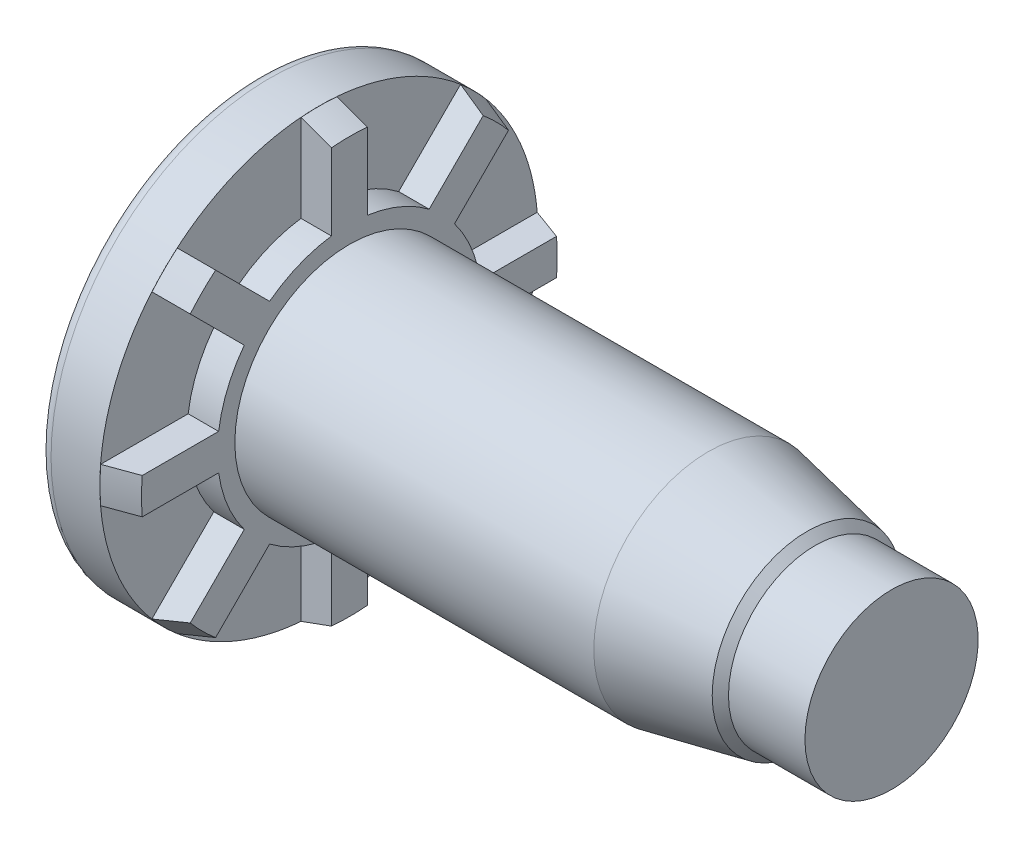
ISO-10303-21;
HEADER;
FILE_DESCRIPTION(('STEP AP214'),'2;1');
FILE_NAME('part.step','',(''),(''),'','','');
FILE_SCHEMA(('AUTOMOTIVE_DESIGN { 1 0 10303 214 1 1 1 1 }'));
ENDSEC;
DATA;
#1=APPLICATION_CONTEXT('core data for automotive mechanical design processes');
#2=APPLICATION_PROTOCOL_DEFINITION('international standard','automotive_design',2000,#1);
#3=PRODUCT_CONTEXT('',#1,'mechanical');
#4=PRODUCT('Part','Part','',(#3));
#5=PRODUCT_RELATED_PRODUCT_CATEGORY('part','',(#4));
#6=PRODUCT_DEFINITION_FORMATION('','',#4);
#7=PRODUCT_DEFINITION_CONTEXT('part definition',#1,'design');
#8=PRODUCT_DEFINITION('design','',#6,#7);
#9=PRODUCT_DEFINITION_SHAPE('','',#8);
#10=(LENGTH_UNIT() NAMED_UNIT(*) SI_UNIT(.MILLI.,.METRE.));
#11=(NAMED_UNIT(*) PLANE_ANGLE_UNIT() SI_UNIT($,.RADIAN.));
#12=(NAMED_UNIT(*) SI_UNIT($,.STERADIAN.) SOLID_ANGLE_UNIT());
#13=UNCERTAINTY_MEASURE_WITH_UNIT(LENGTH_MEASURE(1.E-05),#10,'distance_accuracy_value','');
#14=(GEOMETRIC_REPRESENTATION_CONTEXT(3) GLOBAL_UNCERTAINTY_ASSIGNED_CONTEXT((#13)) GLOBAL_UNIT_ASSIGNED_CONTEXT((#10,
#11,#12)) REPRESENTATION_CONTEXT('',''));
#15=CARTESIAN_POINT('',(0.,0.,0.));
#16=DIRECTION('',(0.,0.,1.));
#17=DIRECTION('',(1.,0.,0.));
#18=AXIS2_PLACEMENT_3D('',#15,#16,#17);
#19=CARTESIAN_POINT('',(0.00254,0.,0.));
#20=DIRECTION('',(-1.,0.,0.));
#21=DIRECTION('',(0.,0.,1.));
#22=AXIS2_PLACEMENT_3D('',#19,#20,#21);
#23=CONICAL_SURFACE('',#22,7.64746,0.349065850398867);
#24=CARTESIAN_POINT('',(1.06519999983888,4.6725133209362,5.55744028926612));
#25=CARTESIAN_POINT('',(0.88806050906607,4.7182729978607,5.60319996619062));
#26=CARTESIAN_POINT('',(0.7109190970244,4.76402895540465,5.64895592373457));
#27=CARTESIAN_POINT('',(0.356632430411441,4.85553343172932,5.74046040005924));
#28=CARTESIAN_POINT('',(0.179487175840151,4.90128195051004,5.78620891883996));
#29=CARTESIAN_POINT('',(0.00234000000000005,4.94702674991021,5.83195371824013));
#30=B_SPLINE_CURVE_WITH_KNOTS('',3,(#24,#25,#26,#27,#28,#29),.UNSPECIFIED.,.F.,.F.,(4,2,4),(0.,
0.5657708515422,1.13154170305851),.UNSPECIFIED.);
#31=CARTESIAN_POINT('',(1.06499999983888,4.67256498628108,5.557491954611));
#32=VERTEX_POINT('',#31);
#33=CARTESIAN_POINT('',(0.00254,4.9469751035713,5.83190207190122));
#34=VERTEX_POINT('',#33);
#35=EDGE_CURVE('E564',#32,#34,#30,.T.);
#36=ORIENTED_EDGE('',*,*,#35,.F.);
#37=CARTESIAN_POINT('',(1.065,0.,0.));
#38=DIRECTION('',(-1.,0.,0.));
#39=DIRECTION('',(0.,0.,1.));
#40=AXIS2_PLACEMENT_3D('',#37,#38,#39);
#41=CIRCLE('',#40,7.26075618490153);
#42=CARTESIAN_POINT('',(1.06499999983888,5.55749195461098,4.6725649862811));
#43=VERTEX_POINT('',#42);
#44=EDGE_CURVE('E567',#32,#43,#41,.T.);
#45=ORIENTED_EDGE('',*,*,#44,.T.);
#46=CARTESIAN_POINT('',(0.00234,5.83195371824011,4.94702674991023));
#47=CARTESIAN_POINT('',(0.179487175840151,5.78620891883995,4.90128195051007));
#48=CARTESIAN_POINT('',(0.35663243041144,5.74046040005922,4.85553343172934));
#49=CARTESIAN_POINT('',(0.7109190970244,5.64895592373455,4.76402895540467));
#50=CARTESIAN_POINT('',(0.88806050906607,5.60319996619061,4.71827299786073));
#51=CARTESIAN_POINT('',(1.06519999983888,5.5574402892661,4.67251332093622));
#52=B_SPLINE_CURVE_WITH_KNOTS('',3,(#46,#47,#48,#49,#50,#51),.UNSPECIFIED.,.F.,.F.,(4,2,4),(0.,
0.565770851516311,1.13154170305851),.UNSPECIFIED.);
#53=CARTESIAN_POINT('',(0.00254,5.8319020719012,4.94697510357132));
#54=VERTEX_POINT('',#53);
#55=EDGE_CURVE('E459',#54,#43,#52,.T.);
#56=ORIENTED_EDGE('',*,*,#55,.F.);
#57=CARTESIAN_POINT('',(0.00254,0.,0.));
#58=DIRECTION('',(-1.,0.,0.));
#59=DIRECTION('',(0.,0.,1.));
#60=AXIS2_PLACEMENT_3D('',#57,#58,#59);
#61=CIRCLE('',#60,7.64746);
#62=EDGE_CURVE('E569',#34,#54,#61,.T.);
#63=ORIENTED_EDGE('',*,*,#62,.F.);
#64=EDGE_LOOP('',(#36,#45,#56,#63));
#65=FACE_BOUND('',#64,.T.);
#66=ADVANCED_FACE('F39',(#65),#23,.T.);
#67=CARTESIAN_POINT('',(1.06519999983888,-5.55744028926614,4.67251332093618));
#68=CARTESIAN_POINT('',(0.888060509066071,-5.60319996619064,4.71827299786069));
#69=CARTESIAN_POINT('',(0.7109190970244,-5.64895592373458,4.76402895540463));
#70=CARTESIAN_POINT('',(0.356632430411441,-5.74046040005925,4.8555334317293));
#71=CARTESIAN_POINT('',(0.179487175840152,-5.78620891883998,4.90128195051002));
#72=CARTESIAN_POINT('',(0.00234000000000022,-5.83195371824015,4.94702674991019));
#73=B_SPLINE_CURVE_WITH_KNOTS('',3,(#67,#68,#69,#70,#71,#72),.UNSPECIFIED.,.F.,.F.,(4,2,4),(0.,
0.5657708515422,1.13154170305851),.UNSPECIFIED.);
#74=CARTESIAN_POINT('',(1.06499999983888,-5.55749195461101,4.67256498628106));
#75=VERTEX_POINT('',#74);
#76=CARTESIAN_POINT('',(0.00254,-5.83190207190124,4.94697510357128));
#77=VERTEX_POINT('',#76);
#78=EDGE_CURVE('E617',#75,#77,#73,.T.);
#79=ORIENTED_EDGE('',*,*,#78,.F.);
#80=CARTESIAN_POINT('',(1.06499999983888,-4.67256498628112,5.55749195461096));
#81=VERTEX_POINT('',#80);
#82=EDGE_CURVE('E581',#75,#81,#41,.T.);
#83=ORIENTED_EDGE('',*,*,#82,.T.);
#84=CARTESIAN_POINT('',(0.00233999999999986,-4.94702674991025,5.8319537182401));
#85=CARTESIAN_POINT('',(0.179487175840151,-4.90128195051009,5.78620891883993));
#86=CARTESIAN_POINT('',(0.35663243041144,-4.85553343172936,5.7404604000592));
#87=CARTESIAN_POINT('',(0.7109190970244,-4.76402895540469,5.64895592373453));
#88=CARTESIAN_POINT('',(0.88806050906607,-4.71827299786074,5.60319996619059));
#89=CARTESIAN_POINT('',(1.06519999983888,-4.67251332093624,5.55744028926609));
#90=B_SPLINE_CURVE_WITH_KNOTS('',3,(#84,#85,#86,#87,#88,#89),.UNSPECIFIED.,.F.,.F.,(4,2,4),(0.,
0.565770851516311,1.13154170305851),.UNSPECIFIED.);
#91=CARTESIAN_POINT('',(0.00254,-4.94697510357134,5.83190207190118));
#92=VERTEX_POINT('',#91);
#93=EDGE_CURVE('E615',#92,#81,#90,.T.);
#94=ORIENTED_EDGE('',*,*,#93,.F.);
#95=EDGE_CURVE('E767',#77,#92,#61,.T.);
#96=ORIENTED_EDGE('',*,*,#95,.F.);
#97=EDGE_LOOP('',(#79,#83,#94,#96));
#98=FACE_BOUND('',#97,.T.);
#99=ADVANCED_FACE('F555',(#98),#23,.T.);
#100=CARTESIAN_POINT('',(-5.38253698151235,0.625737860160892,9.58706880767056));
#101=CARTESIAN_POINT('',(-4.38643509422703,0.625737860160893,9.22374010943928));
#102=CARTESIAN_POINT('',(-3.39035751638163,0.625737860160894,8.86034473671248));
#103=CARTESIAN_POINT('',(-1.39828490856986,0.625737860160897,8.13332824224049));
#104=CARTESIAN_POINT('',(-0.402289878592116,0.625737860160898,7.76970712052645));
#105=CARTESIAN_POINT('',(1.58958408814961,0.625737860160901,7.0421465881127));
#106=CARTESIAN_POINT('',(2.58546302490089,0.625737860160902,6.67820717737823));
#107=CARTESIAN_POINT('',(4.57701716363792,0.625737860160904,5.94977096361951));
#108=CARTESIAN_POINT('',(5.57269236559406,0.625737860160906,5.58527416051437));
#109=CARTESIAN_POINT('',(6.56822178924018,0.625737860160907,5.22037914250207));
#110=B_SPLINE_CURVE_WITH_KNOTS('',3,(#100,#101,#102,#103,#104,#105,#106,#107,#108,#109),
.UNSPECIFIED.,.F.,.F.,(4,2,2,2,4),(0.,3.18088674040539,6.36177304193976,9.54265969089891,
12.7235468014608),.UNSPECIFIED.);
#111=CARTESIAN_POINT('',(0.00254,0.625737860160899,7.62181714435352));
#112=VERTEX_POINT('',#111);
#113=CARTESIAN_POINT('',(1.06499999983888,0.6257378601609,7.2337426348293));
#114=VERTEX_POINT('',#113);
#115=EDGE_CURVE('E572',#112,#114,#110,.T.);
#116=ORIENTED_EDGE('',*,*,#115,.F.);
#117=CARTESIAN_POINT('',(0.00254,-0.625737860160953,7.62181714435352));
#118=VERTEX_POINT('',#117);
#119=EDGE_CURVE('E696',#118,#112,#61,.T.);
#120=ORIENTED_EDGE('',*,*,#119,.F.);
#121=CARTESIAN_POINT('',(6.56822178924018,-0.625737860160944,5.22037914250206));
#122=CARTESIAN_POINT('',(5.57269236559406,-0.625737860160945,5.58527416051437));
#123=CARTESIAN_POINT('',(4.57701716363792,-0.625737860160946,5.9497709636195));
#124=CARTESIAN_POINT('',(2.58546302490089,-0.625737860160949,6.67820717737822));
#125=CARTESIAN_POINT('',(1.58958408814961,-0.62573786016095,7.04214658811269));
#126=CARTESIAN_POINT('',(-0.402289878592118,-0.625737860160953,7.76970712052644));
#127=CARTESIAN_POINT('',(-1.39828490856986,-0.625737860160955,8.13332824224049));
#128=CARTESIAN_POINT('',(-3.39035751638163,-0.625737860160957,8.86034473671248));
#129=CARTESIAN_POINT('',(-4.38643509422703,-0.625737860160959,9.22374010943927));
#130=CARTESIAN_POINT('',(-5.38253698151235,-0.62573786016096,9.58706880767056));
#131=B_SPLINE_CURVE_WITH_KNOTS('',3,(#121,#122,#123,#124,#125,#126,#127,#128,#129,#130),
.UNSPECIFIED.,.F.,.F.,(4,2,2,2,4),(0.,3.18088711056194,6.36177375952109,9.54266006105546,
12.7235468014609),.UNSPECIFIED.);
#132=CARTESIAN_POINT('',(1.06499999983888,-0.625737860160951,7.23374263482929));
#133=VERTEX_POINT('',#132);
#134=EDGE_CURVE('E635',#133,#118,#131,.T.);
#135=ORIENTED_EDGE('',*,*,#134,.F.);
#136=EDGE_CURVE('E576',#133,#114,#41,.T.);
#137=ORIENTED_EDGE('',*,*,#136,.T.);
#138=EDGE_LOOP('',(#116,#120,#135,#137));
#139=FACE_BOUND('',#138,.T.);
#140=ADVANCED_FACE('F560',(#139),#23,.T.);
#141=CARTESIAN_POINT('',(6.56822178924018,0.62573786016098,-5.22037914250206));
#142=CARTESIAN_POINT('',(5.57269236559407,0.625737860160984,-5.58527416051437));
#143=CARTESIAN_POINT('',(4.57701716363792,0.625737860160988,-5.9497709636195));
#144=CARTESIAN_POINT('',(2.58546302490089,0.625737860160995,-6.67820717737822));
#145=CARTESIAN_POINT('',(1.58958408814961,0.625737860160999,-7.04214658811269));
#146=CARTESIAN_POINT('',(-0.402289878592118,0.625737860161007,-7.76970712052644));
#147=CARTESIAN_POINT('',(-1.39828490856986,0.625737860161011,-8.13332824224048));
#148=CARTESIAN_POINT('',(-3.39035751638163,0.625737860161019,-8.86034473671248));
#149=CARTESIAN_POINT('',(-4.38643509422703,0.625737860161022,-9.22374010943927));
#150=CARTESIAN_POINT('',(-5.38253698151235,0.625737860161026,-9.58706880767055));
#151=B_SPLINE_CURVE_WITH_KNOTS('',3,(#141,#142,#143,#144,#145,#146,#147,#148,#149,#150),
.UNSPECIFIED.,.F.,.F.,(4,2,2,2,4),(0.,3.18088711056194,6.36177375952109,9.54266006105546,
12.7235468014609),.UNSPECIFIED.);
#152=CARTESIAN_POINT('',(1.06499999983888,0.625737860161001,-7.23374263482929));
#153=VERTEX_POINT('',#152);
#154=CARTESIAN_POINT('',(0.00254,0.625737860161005,-7.62181714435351));
#155=VERTEX_POINT('',#154);
#156=EDGE_CURVE('E711',#153,#155,#151,.T.);
#157=ORIENTED_EDGE('',*,*,#156,.F.);
#158=CARTESIAN_POINT('',(1.06499999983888,-0.625737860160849,-7.2337426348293));
#159=VERTEX_POINT('',#158);
#160=EDGE_CURVE('E583',#153,#159,#41,.T.);
#161=ORIENTED_EDGE('',*,*,#160,.T.);
#162=CARTESIAN_POINT('',(-5.38253698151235,-0.625737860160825,-9.58706880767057));
#163=CARTESIAN_POINT('',(-4.38643509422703,-0.625737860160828,-9.22374010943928));
#164=CARTESIAN_POINT('',(-3.39035751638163,-0.625737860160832,-8.86034473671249));
#165=CARTESIAN_POINT('',(-1.39828490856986,-0.62573786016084,-8.1333282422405));
#166=CARTESIAN_POINT('',(-0.402289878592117,-0.625737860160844,-7.76970712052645));
#167=CARTESIAN_POINT('',(1.58958408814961,-0.625737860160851,-7.0421465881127));
#168=CARTESIAN_POINT('',(2.58546302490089,-0.625737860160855,-6.67820717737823));
#169=CARTESIAN_POINT('',(4.57701716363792,-0.625737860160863,-5.94977096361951));
#170=CARTESIAN_POINT('',(5.57269236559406,-0.625737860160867,-5.58527416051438));
#171=CARTESIAN_POINT('',(6.56822178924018,-0.625737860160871,-5.22037914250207));
#172=B_SPLINE_CURVE_WITH_KNOTS('',3,(#162,#163,#164,#165,#166,#167,#168,#169,#170,#171),
.UNSPECIFIED.,.F.,.F.,(4,2,2,2,4),(0.,3.18088674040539,6.36177304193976,9.54265969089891,
12.7235468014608),.UNSPECIFIED.);
#173=CARTESIAN_POINT('',(0.00254,-0.625737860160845,-7.62181714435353));
#174=VERTEX_POINT('',#173);
#175=EDGE_CURVE('E715',#174,#159,#172,.T.);
#176=ORIENTED_EDGE('',*,*,#175,.F.);
#177=EDGE_CURVE('E689',#155,#174,#61,.T.);
#178=ORIENTED_EDGE('',*,*,#177,.F.);
#179=EDGE_LOOP('',(#157,#161,#176,#178));
#180=FACE_BOUND('',#179,.T.);
#181=ADVANCED_FACE('F950',(#180),#23,.T.);
#182=CARTESIAN_POINT('',(1.06519999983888,-4.67251332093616,-5.55744028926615));
#183=CARTESIAN_POINT('',(0.88806050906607,-4.71827299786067,-5.60319996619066));
#184=CARTESIAN_POINT('',(0.7109190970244,-4.76402895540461,-5.6489559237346));
#185=CARTESIAN_POINT('',(0.356632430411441,-4.85553343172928,-5.74046040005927));
#186=CARTESIAN_POINT('',(0.179487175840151,-4.90128195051,-5.78620891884));
#187=CARTESIAN_POINT('',(0.00233999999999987,-4.94702674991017,-5.83195371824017));
#188=B_SPLINE_CURVE_WITH_KNOTS('',3,(#182,#183,#184,#185,#186,#187),.UNSPECIFIED.,.F.,.F.,(4,2,
4),(0.,0.5657708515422,1.13154170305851),.UNSPECIFIED.);
#189=CARTESIAN_POINT('',(1.06499999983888,-4.67256498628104,-5.55749195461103));
#190=VERTEX_POINT('',#189);
#191=CARTESIAN_POINT('',(0.00254,-4.94697510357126,-5.83190207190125));
#192=VERTEX_POINT('',#191);
#193=EDGE_CURVE('E712',#190,#192,#188,.T.);
#194=ORIENTED_EDGE('',*,*,#193,.F.);
#195=CARTESIAN_POINT('',(1.06499999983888,-5.55749195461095,-4.67256498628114));
#196=VERTEX_POINT('',#195);
#197=EDGE_CURVE('E594',#190,#196,#41,.T.);
#198=ORIENTED_EDGE('',*,*,#197,.T.);
#199=CARTESIAN_POINT('',(0.00234000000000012,-5.83195371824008,-4.94702674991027));
#200=CARTESIAN_POINT('',(0.179487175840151,-5.78620891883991,-4.90128195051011));
#201=CARTESIAN_POINT('',(0.35663243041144,-5.74046040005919,-4.85553343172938));
#202=CARTESIAN_POINT('',(0.7109190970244,-5.64895592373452,-4.76402895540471));
#203=CARTESIAN_POINT('',(0.88806050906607,-5.60319996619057,-4.71827299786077));
#204=CARTESIAN_POINT('',(1.06519999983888,-5.55744028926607,-4.67251332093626));
#205=B_SPLINE_CURVE_WITH_KNOTS('',3,(#199,#200,#201,#202,#203,#204),.UNSPECIFIED.,.F.,.F.,(4,2,
4),(0.,0.565770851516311,1.13154170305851),.UNSPECIFIED.);
#206=CARTESIAN_POINT('',(0.00254,-5.83190207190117,-4.94697510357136));
#207=VERTEX_POINT('',#206);
#208=EDGE_CURVE('E327',#207,#196,#205,.T.);
#209=ORIENTED_EDGE('',*,*,#208,.F.);
#210=EDGE_CURVE('E695',#192,#207,#61,.T.);
#211=ORIENTED_EDGE('',*,*,#210,.F.);
#212=EDGE_LOOP('',(#194,#198,#209,#211));
#213=FACE_BOUND('',#212,.T.);
#214=ADVANCED_FACE('F947',(#213),#23,.T.);
#215=CARTESIAN_POINT('',(-5.38253698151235,-9.58706880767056,0.625737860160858));
#216=CARTESIAN_POINT('',(-4.38643509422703,-9.22374010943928,0.625737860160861));
#217=CARTESIAN_POINT('',(-3.39035751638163,-8.86034473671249,0.625737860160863));
#218=CARTESIAN_POINT('',(-1.39828490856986,-8.13332824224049,0.625737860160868));
#219=CARTESIAN_POINT('',(-0.402289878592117,-7.76970712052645,0.625737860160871));
#220=CARTESIAN_POINT('',(1.58958408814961,-7.0421465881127,0.625737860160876));
#221=CARTESIAN_POINT('',(2.58546302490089,-6.67820717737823,0.625737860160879));
#222=CARTESIAN_POINT('',(4.57701716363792,-5.94977096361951,0.625737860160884));
#223=CARTESIAN_POINT('',(5.57269236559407,-5.58527416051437,0.625737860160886));
#224=CARTESIAN_POINT('',(6.56822178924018,-5.22037914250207,0.625737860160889));
#225=B_SPLINE_CURVE_WITH_KNOTS('',3,(#215,#216,#217,#218,#219,#220,#221,#222,#223,#224),
.UNSPECIFIED.,.F.,.F.,(4,2,2,2,4),(0.,3.18088674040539,6.36177304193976,9.54265969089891,
12.7235468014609),.UNSPECIFIED.);
#226=CARTESIAN_POINT('',(0.00254,-7.62181714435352,0.625737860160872));
#227=VERTEX_POINT('',#226);
#228=CARTESIAN_POINT('',(1.06499999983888,-7.2337426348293,0.625737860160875));
#229=VERTEX_POINT('',#228);
#230=EDGE_CURVE('E766',#227,#229,#225,.T.);
#231=ORIENTED_EDGE('',*,*,#230,.F.);
#232=CARTESIAN_POINT('',(0.00254,-7.62181714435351,-0.625737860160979));
#233=VERTEX_POINT('',#232);
#234=EDGE_CURVE('E760',#233,#227,#61,.T.);
#235=ORIENTED_EDGE('',*,*,#234,.F.);
#236=CARTESIAN_POINT('',(6.56822178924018,-5.22037914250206,-0.625737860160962));
#237=CARTESIAN_POINT('',(5.57269236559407,-5.58527416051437,-0.625737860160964));
#238=CARTESIAN_POINT('',(4.57701716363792,-5.9497709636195,-0.625737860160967));
#239=CARTESIAN_POINT('',(2.58546302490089,-6.67820717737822,-0.625737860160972));
#240=CARTESIAN_POINT('',(1.58958408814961,-7.04214658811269,-0.625737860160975));
#241=CARTESIAN_POINT('',(-0.402289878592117,-7.76970712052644,-0.62573786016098));
#242=CARTESIAN_POINT('',(-1.39828490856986,-8.13332824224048,-0.625737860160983));
#243=CARTESIAN_POINT('',(-3.39035751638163,-8.86034473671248,-0.625737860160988));
#244=CARTESIAN_POINT('',(-4.38643509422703,-9.22374010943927,-0.625737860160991));
#245=CARTESIAN_POINT('',(-5.38253698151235,-9.58706880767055,-0.625737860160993));
#246=B_SPLINE_CURVE_WITH_KNOTS('',3,(#236,#237,#238,#239,#240,#241,#242,#243,#244,#245),
.UNSPECIFIED.,.F.,.F.,(4,2,2,2,4),(0.,3.18088711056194,6.36177375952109,9.54266006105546,
12.7235468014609),.UNSPECIFIED.);
#247=CARTESIAN_POINT('',(1.06499999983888,-7.23374263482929,-0.625737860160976));
#248=VERTEX_POINT('',#247);
#249=EDGE_CURVE('E427',#248,#233,#246,.T.);
#250=ORIENTED_EDGE('',*,*,#249,.F.);
#251=EDGE_CURVE('E600',#248,#229,#41,.T.);
#252=ORIENTED_EDGE('',*,*,#251,.T.);
#253=EDGE_LOOP('',(#231,#235,#250,#252));
#254=FACE_BOUND('',#253,.T.);
#255=ADVANCED_FACE('F765',(#254),#23,.T.);
#256=CARTESIAN_POINT('',(0.,0.,0.));
#257=DIRECTION('',(-1.,0.,0.));
#258=DIRECTION('',(0.,0.,1.));
#259=AXIS2_PLACEMENT_3D('',#256,#257,#258);
#260=CYLINDRICAL_SURFACE('',#259,7.64746);
#261=CARTESIAN_POINT('',(0.,0.,0.));
#262=DIRECTION('',(-1.,0.,0.));
#263=DIRECTION('',(0.,0.,1.));
#264=AXIS2_PLACEMENT_3D('',#261,#262,#263);
#265=CIRCLE('',#264,7.64746);
#266=CARTESIAN_POINT('',(0.,4.9469751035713,5.83190207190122));
#267=VERTEX_POINT('',#266);
#268=CARTESIAN_POINT('',(-1.61121550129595E-10,5.8319020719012,4.94697510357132));
#269=VERTEX_POINT('',#268);
#270=EDGE_CURVE('E644',#267,#269,#265,.T.);
#271=ORIENTED_EDGE('',*,*,#270,.F.);
#272=DIRECTION('',(-1.,0.,0.));
#273=VECTOR('',#272,1.);
#274=CARTESIAN_POINT('',(0.,4.9469751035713,5.83190207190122));
#275=LINE('',#274,#273);
#276=EDGE_CURVE('E11',#267,#34,#275,.F.);
#277=ORIENTED_EDGE('',*,*,#276,.T.);
#278=ORIENTED_EDGE('',*,*,#62,.T.);
#279=DIRECTION('',(-1.,0.,0.));
#280=VECTOR('',#279,1.);
#281=CARTESIAN_POINT('',(0.,5.8319020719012,4.94697510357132));
#282=LINE('',#281,#280);
#283=EDGE_CURVE('E706',#54,#269,#282,.T.);
#284=ORIENTED_EDGE('',*,*,#283,.T.);
#285=EDGE_LOOP('',(#271,#277,#278,#284));
#286=FACE_BOUND('',#285,.T.);
#287=ADVANCED_FACE('F509',(#286),#260,.T.);
#288=CARTESIAN_POINT('',(0.,-5.83190207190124,4.94697510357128));
#289=VERTEX_POINT('',#288);
#290=CARTESIAN_POINT('',(-1.61121550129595E-10,-4.94697510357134,5.83190207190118));
#291=VERTEX_POINT('',#290);
#292=EDGE_CURVE('E643',#289,#291,#265,.T.);
#293=ORIENTED_EDGE('',*,*,#292,.F.);
#294=DIRECTION('',(-1.,0.,0.));
#295=VECTOR('',#294,1.);
#296=CARTESIAN_POINT('',(0.,-5.83190207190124,4.94697510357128));
#297=LINE('',#296,#295);
#298=EDGE_CURVE('E877',#289,#77,#297,.F.);
#299=ORIENTED_EDGE('',*,*,#298,.T.);
#300=ORIENTED_EDGE('',*,*,#95,.T.);
#301=DIRECTION('',(-1.,0.,0.));
#302=VECTOR('',#301,1.);
#303=CARTESIAN_POINT('',(0.,-4.94697510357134,5.83190207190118));
#304=LINE('',#303,#302);
#305=EDGE_CURVE('E640',#92,#291,#304,.T.);
#306=ORIENTED_EDGE('',*,*,#305,.T.);
#307=EDGE_LOOP('',(#293,#299,#300,#306));
#308=FACE_BOUND('',#307,.T.);
#309=ADVANCED_FACE('F880',(#308),#260,.T.);
#310=ORIENTED_EDGE('',*,*,#119,.T.);
#311=DIRECTION('',(-1.,0.,0.));
#312=VECTOR('',#311,1.);
#313=CARTESIAN_POINT('',(0.,0.625737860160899,7.62181714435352));
#314=LINE('',#313,#312);
#315=CARTESIAN_POINT('',(-1.61121550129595E-10,0.625737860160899,7.62181714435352));
#316=VERTEX_POINT('',#315);
#317=EDGE_CURVE('E48',#112,#316,#314,.T.);
#318=ORIENTED_EDGE('',*,*,#317,.T.);
#319=CARTESIAN_POINT('',(0.,-0.625737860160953,7.62181714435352));
#320=VERTEX_POINT('',#319);
#321=EDGE_CURVE('E303',#320,#316,#265,.T.);
#322=ORIENTED_EDGE('',*,*,#321,.F.);
#323=DIRECTION('',(-1.,0.,0.));
#324=VECTOR('',#323,1.);
#325=CARTESIAN_POINT('',(0.,-0.625737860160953,7.62181714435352));
#326=LINE('',#325,#324);
#327=EDGE_CURVE('E633',#320,#118,#326,.F.);
#328=ORIENTED_EDGE('',*,*,#327,.T.);
#329=EDGE_LOOP('',(#310,#318,#322,#328));
#330=FACE_BOUND('',#329,.T.);
#331=ADVANCED_FACE('F642',(#330),#260,.T.);
#332=CARTESIAN_POINT('',(0.,0.625737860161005,-7.62181714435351));
#333=VERTEX_POINT('',#332);
#334=CARTESIAN_POINT('',(-1.61121550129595E-10,-0.625737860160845,-7.62181714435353));
#335=VERTEX_POINT('',#334);
#336=EDGE_CURVE('E652',#333,#335,#265,.T.);
#337=ORIENTED_EDGE('',*,*,#336,.F.);
#338=DIRECTION('',(-1.,0.,0.));
#339=VECTOR('',#338,1.);
#340=CARTESIAN_POINT('',(0.,0.625737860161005,-7.62181714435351));
#341=LINE('',#340,#339);
#342=EDGE_CURVE('E881',#333,#155,#341,.F.);
#343=ORIENTED_EDGE('',*,*,#342,.T.);
#344=ORIENTED_EDGE('',*,*,#177,.T.);
#345=DIRECTION('',(-1.,0.,0.));
#346=VECTOR('',#345,1.);
#347=CARTESIAN_POINT('',(0.,-0.625737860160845,-7.62181714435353));
#348=LINE('',#347,#346);
#349=EDGE_CURVE('E762',#174,#335,#348,.T.);
#350=ORIENTED_EDGE('',*,*,#349,.T.);
#351=EDGE_LOOP('',(#337,#343,#344,#350));
#352=FACE_BOUND('',#351,.T.);
#353=ADVANCED_FACE('F859',(#352),#260,.T.);
#354=CARTESIAN_POINT('',(0.,-4.94697510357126,-5.83190207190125));
#355=VERTEX_POINT('',#354);
#356=CARTESIAN_POINT('',(-1.61121550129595E-10,-5.83190207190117,-4.94697510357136));
#357=VERTEX_POINT('',#356);
#358=EDGE_CURVE('E865',#355,#357,#265,.T.);
#359=ORIENTED_EDGE('',*,*,#358,.F.);
#360=DIRECTION('',(-1.,0.,0.));
#361=VECTOR('',#360,1.);
#362=CARTESIAN_POINT('',(0.,-4.94697510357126,-5.83190207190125));
#363=LINE('',#362,#361);
#364=EDGE_CURVE('E861',#355,#192,#363,.F.);
#365=ORIENTED_EDGE('',*,*,#364,.T.);
#366=ORIENTED_EDGE('',*,*,#210,.T.);
#367=DIRECTION('',(-1.,0.,0.));
#368=VECTOR('',#367,1.);
#369=CARTESIAN_POINT('',(0.,-5.83190207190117,-4.94697510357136));
#370=LINE('',#369,#368);
#371=EDGE_CURVE('E763',#207,#357,#370,.T.);
#372=ORIENTED_EDGE('',*,*,#371,.T.);
#373=EDGE_LOOP('',(#359,#365,#366,#372));
#374=FACE_BOUND('',#373,.T.);
#375=ADVANCED_FACE('F937',(#374),#260,.T.);
#376=ORIENTED_EDGE('',*,*,#234,.T.);
#377=DIRECTION('',(-1.,0.,0.));
#378=VECTOR('',#377,1.);
#379=CARTESIAN_POINT('',(0.,-7.62181714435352,0.625737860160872));
#380=LINE('',#379,#378);
#381=CARTESIAN_POINT('',(-1.61121550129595E-10,-7.62181714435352,0.625737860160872));
#382=VERTEX_POINT('',#381);
#383=EDGE_CURVE('E639',#227,#382,#380,.T.);
#384=ORIENTED_EDGE('',*,*,#383,.T.);
#385=CARTESIAN_POINT('',(0.,-7.62181714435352,-0.625737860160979));
#386=VERTEX_POINT('',#385);
#387=EDGE_CURVE('E646',#386,#382,#265,.T.);
#388=ORIENTED_EDGE('',*,*,#387,.F.);
#389=DIRECTION('',(-1.,0.,0.));
#390=VECTOR('',#389,1.);
#391=CARTESIAN_POINT('',(0.,-7.62181714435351,-0.625737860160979));
#392=LINE('',#391,#390);
#393=EDGE_CURVE('E752',#386,#233,#392,.F.);
#394=ORIENTED_EDGE('',*,*,#393,.T.);
#395=EDGE_LOOP('',(#376,#384,#388,#394));
#396=FACE_BOUND('',#395,.T.);
#397=ADVANCED_FACE('F758',(#396),#260,.T.);
#398=CARTESIAN_POINT('',(6.56822178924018,5.22037914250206,0.625737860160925));
#399=CARTESIAN_POINT('',(5.57269236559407,5.58527416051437,0.625737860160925));
#400=CARTESIAN_POINT('',(4.57701716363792,5.94977096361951,0.625737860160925));
#401=CARTESIAN_POINT('',(2.58546302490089,6.67820717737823,0.625737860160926));
#402=CARTESIAN_POINT('',(1.58958408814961,7.04214658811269,0.625737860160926));
#403=CARTESIAN_POINT('',(-0.402289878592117,7.76970712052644,0.625737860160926));
#404=CARTESIAN_POINT('',(-1.39828490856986,8.13332824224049,0.625737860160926));
#405=CARTESIAN_POINT('',(-3.39035751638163,8.86034473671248,0.625737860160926));
#406=CARTESIAN_POINT('',(-4.38643509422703,9.22374010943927,0.625737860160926));
#407=CARTESIAN_POINT('',(-5.38253698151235,9.58706880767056,0.625737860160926));
#408=B_SPLINE_CURVE_WITH_KNOTS('',3,(#398,#399,#400,#401,#402,#403,#404,#405,#406,#407),
.UNSPECIFIED.,.F.,.F.,(4,2,2,2,4),(0.,3.18088711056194,6.36177375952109,9.54266006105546,
12.7235468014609),.UNSPECIFIED.);
#409=CARTESIAN_POINT('',(1.06499999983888,7.23374263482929,0.625737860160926));
#410=VERTEX_POINT('',#409);
#411=CARTESIAN_POINT('',(0.00254,7.62181714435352,0.625737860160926));
#412=VERTEX_POINT('',#411);
#413=EDGE_CURVE('E451',#410,#412,#408,.T.);
#414=ORIENTED_EDGE('',*,*,#413,.F.);
#415=CARTESIAN_POINT('',(1.06499999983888,7.23374263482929,-0.625737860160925));
#416=VERTEX_POINT('',#415);
#417=EDGE_CURVE('E577',#410,#416,#41,.T.);
#418=ORIENTED_EDGE('',*,*,#417,.T.);
#419=CARTESIAN_POINT('',(-5.38253698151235,9.58706880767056,-0.625737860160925));
#420=CARTESIAN_POINT('',(-4.38643509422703,9.22374010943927,-0.625737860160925));
#421=CARTESIAN_POINT('',(-3.39035751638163,8.86034473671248,-0.625737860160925));
#422=CARTESIAN_POINT('',(-1.39828490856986,8.13332824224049,-0.625737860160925));
#423=CARTESIAN_POINT('',(-0.402289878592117,7.76970712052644,-0.625737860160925));
#424=CARTESIAN_POINT('',(1.58958408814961,7.04214658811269,-0.625737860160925));
#425=CARTESIAN_POINT('',(2.58546302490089,6.67820717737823,-0.625737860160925));
#426=CARTESIAN_POINT('',(4.57701716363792,5.94977096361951,-0.625737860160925));
#427=CARTESIAN_POINT('',(5.57269236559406,5.58527416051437,-0.625737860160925));
#428=CARTESIAN_POINT('',(6.56822178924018,5.22037914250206,-0.625737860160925));
#429=B_SPLINE_CURVE_WITH_KNOTS('',3,(#419,#420,#421,#422,#423,#424,#425,#426,#427,#428),
.UNSPECIFIED.,.F.,.F.,(4,2,2,2,4),(0.,3.18088674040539,6.36177304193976,9.54265969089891,
12.7235468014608),.UNSPECIFIED.);
#430=CARTESIAN_POINT('',(0.00254,7.62181714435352,-0.625737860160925));
#431=VERTEX_POINT('',#430);
#432=EDGE_CURVE('E481',#431,#416,#429,.T.);
#433=ORIENTED_EDGE('',*,*,#432,.F.);
#434=EDGE_CURVE('E690',#412,#431,#61,.T.);
#435=ORIENTED_EDGE('',*,*,#434,.F.);
#436=EDGE_LOOP('',(#414,#418,#433,#435));
#437=FACE_BOUND('',#436,.T.);
#438=ADVANCED_FACE('F551',(#437),#23,.T.);
#439=CARTESIAN_POINT('',(0.,7.62181714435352,0.625737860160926));
#440=VERTEX_POINT('',#439);
#441=CARTESIAN_POINT('',(-1.61121550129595E-10,7.62181714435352,-0.625737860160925));
#442=VERTEX_POINT('',#441);
#443=EDGE_CURVE('E647',#440,#442,#265,.T.);
#444=ORIENTED_EDGE('',*,*,#443,.F.);
#445=DIRECTION('',(-1.,0.,0.));
#446=VECTOR('',#445,1.);
#447=CARTESIAN_POINT('',(0.,7.62181714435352,0.625737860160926));
#448=LINE('',#447,#446);
#449=EDGE_CURVE('E892',#440,#412,#448,.F.);
#450=ORIENTED_EDGE('',*,*,#449,.T.);
#451=ORIENTED_EDGE('',*,*,#434,.T.);
#452=DIRECTION('',(-1.,0.,0.));
#453=VECTOR('',#452,1.);
#454=CARTESIAN_POINT('',(0.,7.62181714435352,-0.625737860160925));
#455=LINE('',#454,#453);
#456=EDGE_CURVE('E587',#431,#442,#455,.T.);
#457=ORIENTED_EDGE('',*,*,#456,.T.);
#458=EDGE_LOOP('',(#444,#450,#451,#457));
#459=FACE_BOUND('',#458,.T.);
#460=ADVANCED_FACE('F510',(#459),#260,.T.);
#461=CARTESIAN_POINT('',(0.00234,4.94702674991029,-5.83195371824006));
#462=CARTESIAN_POINT('',(0.179487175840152,4.90128195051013,-5.7862089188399));
#463=CARTESIAN_POINT('',(0.356632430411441,4.8555334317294,-5.74046040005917));
#464=CARTESIAN_POINT('',(0.7109190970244,4.76402895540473,-5.6489559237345));
#465=CARTESIAN_POINT('',(0.888060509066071,4.71827299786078,-5.60319996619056));
#466=CARTESIAN_POINT('',(1.06519999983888,4.67251332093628,-5.55744028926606));
#467=B_SPLINE_CURVE_WITH_KNOTS('',3,(#461,#462,#463,#464,#465,#466),.UNSPECIFIED.,.F.,.F.,(4,2,
4),(0.,0.565770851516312,1.13154170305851),.UNSPECIFIED.);
#468=CARTESIAN_POINT('',(0.00254,4.94697510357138,-5.83190207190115));
#469=VERTEX_POINT('',#468);
#470=CARTESIAN_POINT('',(1.06499999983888,4.67256498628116,-5.55749195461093));
#471=VERTEX_POINT('',#470);
#472=EDGE_CURVE('E708',#469,#471,#467,.T.);
#473=ORIENTED_EDGE('',*,*,#472,.F.);
#474=CARTESIAN_POINT('',(0.00254,5.8319020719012,-4.94697510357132));
#475=VERTEX_POINT('',#474);
#476=EDGE_CURVE('E653',#475,#469,#61,.T.);
#477=ORIENTED_EDGE('',*,*,#476,.F.);
#478=CARTESIAN_POINT('',(1.06519999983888,5.5574402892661,-4.67251332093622));
#479=CARTESIAN_POINT('',(0.88806050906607,5.60319996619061,-4.71827299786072));
#480=CARTESIAN_POINT('',(0.7109190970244,5.64895592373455,-4.76402895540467));
#481=CARTESIAN_POINT('',(0.356632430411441,5.74046040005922,-4.85553343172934));
#482=CARTESIAN_POINT('',(0.179487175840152,5.78620891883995,-4.90128195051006));
#483=CARTESIAN_POINT('',(0.00234000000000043,5.83195371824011,-4.94702674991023));
#484=B_SPLINE_CURVE_WITH_KNOTS('',3,(#478,#479,#480,#481,#482,#483),.UNSPECIFIED.,.F.,.F.,(4,2,
4),(0.,0.5657708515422,1.13154170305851),.UNSPECIFIED.);
#485=CARTESIAN_POINT('',(1.06499999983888,5.55749195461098,-4.6725649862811));
#486=VERTEX_POINT('',#485);
#487=EDGE_CURVE('E491',#486,#475,#484,.T.);
#488=ORIENTED_EDGE('',*,*,#487,.F.);
#489=EDGE_CURVE('E579',#486,#471,#41,.T.);
#490=ORIENTED_EDGE('',*,*,#489,.T.);
#491=EDGE_LOOP('',(#473,#477,#488,#490));
#492=FACE_BOUND('',#491,.T.);
#493=ADVANCED_FACE('F41',(#492),#23,.T.);
#494=CARTESIAN_POINT('',(1.065,7.26075618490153,0.));
#495=DIRECTION('',(1.,0.,0.));
#496=DIRECTION('',(0.,0.,-1.));
#497=AXIS2_PLACEMENT_3D('',#494,#495,#496);
#498=PLANE('',#497);
#499=DIRECTION('',(0.,0.707106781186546,0.707106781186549));
#500=VECTOR('',#499,1.);
#501=CARTESIAN_POINT('',(1.06499999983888,2.78594078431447,3.67086775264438));
#502=LINE('',#501,#500);
#503=CARTESIAN_POINT('',(1.06499999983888,2.78594078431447,3.67086775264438));
#504=VERTEX_POINT('',#503);
#505=EDGE_CURVE('E306',#504,#32,#502,.T.);
#506=ORIENTED_EDGE('',*,*,#505,.F.);
#507=CARTESIAN_POINT('',(1.06499999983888,0.,0.));
#508=DIRECTION('',(-1.,0.,0.));
#509=DIRECTION('',(0.,1.,0.));
#510=AXIS2_PLACEMENT_3D('',#507,#508,#509);
#511=CIRCLE('',#510,4.60833333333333);
#512=CARTESIAN_POINT('',(1.06499999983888,0.625737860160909,4.5656531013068));
#513=VERTEX_POINT('',#512);
#514=EDGE_CURVE('E323',#513,#504,#511,.T.);
#515=ORIENTED_EDGE('',*,*,#514,.F.);
#516=DIRECTION('',(0.,0.,-1.));
#517=VECTOR('',#516,1.);
#518=CARTESIAN_POINT('',(1.06499999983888,0.625737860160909,4.5656531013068));
#519=LINE('',#518,#517);
#520=EDGE_CURVE('E312',#114,#513,#519,.T.);
#521=ORIENTED_EDGE('',*,*,#520,.F.);
#522=ORIENTED_EDGE('',*,*,#136,.F.);
#523=DIRECTION('',(0.,0.,1.));
#524=VECTOR('',#523,1.);
#525=CARTESIAN_POINT('',(1.06499999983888,-0.625737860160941,4.56565310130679));
#526=LINE('',#525,#524);
#527=CARTESIAN_POINT('',(1.06499999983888,-0.625737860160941,4.56565310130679));
#528=VERTEX_POINT('',#527);
#529=EDGE_CURVE('E353',#528,#133,#526,.T.);
#530=ORIENTED_EDGE('',*,*,#529,.F.);
#531=CARTESIAN_POINT('',(1.06499999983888,0.,0.));
#532=DIRECTION('',(-1.,0.,0.));
#533=DIRECTION('',(0.,0.707106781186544,0.707106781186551));
#534=AXIS2_PLACEMENT_3D('',#531,#532,#533);
#535=CIRCLE('',#534,4.60833333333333);
#536=CARTESIAN_POINT('',(1.06499999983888,-2.78594078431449,3.67086775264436));
#537=VERTEX_POINT('',#536);
#538=EDGE_CURVE('E358',#537,#528,#535,.T.);
#539=ORIENTED_EDGE('',*,*,#538,.F.);
#540=DIRECTION('',(0.,0.707106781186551,-0.707106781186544));
#541=VECTOR('',#540,1.);
#542=CARTESIAN_POINT('',(1.06499999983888,-2.78594078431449,3.67086775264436));
#543=LINE('',#542,#541);
#544=EDGE_CURVE('E347',#81,#537,#543,.T.);
#545=ORIENTED_EDGE('',*,*,#544,.F.);
#546=ORIENTED_EDGE('',*,*,#82,.F.);
#547=DIRECTION('',(0.,-0.707106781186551,0.707106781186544));
#548=VECTOR('',#547,1.);
#549=CARTESIAN_POINT('',(1.06499999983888,-3.67086775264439,2.78594078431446));
#550=LINE('',#549,#548);
#551=CARTESIAN_POINT('',(1.06499999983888,-3.67086775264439,2.78594078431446));
#552=VERTEX_POINT('',#551);
#553=EDGE_CURVE('E332',#552,#75,#550,.T.);
#554=ORIENTED_EDGE('',*,*,#553,.F.);
#555=CARTESIAN_POINT('',(1.06499999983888,0.,0.));
#556=DIRECTION('',(-1.,0.,0.));
#557=DIRECTION('',(0.,0.,1.));
#558=AXIS2_PLACEMENT_3D('',#555,#556,#557);
#559=CIRCLE('',#558,4.60833333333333);
#560=CARTESIAN_POINT('',(1.06499999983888,-4.5656531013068,0.625737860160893));
#561=VERTEX_POINT('',#560);
#562=EDGE_CURVE('E340',#561,#552,#559,.T.);
#563=ORIENTED_EDGE('',*,*,#562,.F.);
#564=DIRECTION('',(0.,1.,0.));
#565=VECTOR('',#564,1.);
#566=CARTESIAN_POINT('',(1.06499999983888,-4.5656531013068,0.625737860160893));
#567=LINE('',#566,#565);
#568=EDGE_CURVE('E338',#229,#561,#567,.T.);
#569=ORIENTED_EDGE('',*,*,#568,.F.);
#570=ORIENTED_EDGE('',*,*,#251,.F.);
#571=DIRECTION('',(0.,-1.,0.));
#572=VECTOR('',#571,1.);
#573=CARTESIAN_POINT('',(1.06499999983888,-4.56565310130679,-0.625737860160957));
#574=LINE('',#573,#572);
#575=CARTESIAN_POINT('',(1.06499999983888,-4.56565310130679,-0.625737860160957));
#576=VERTEX_POINT('',#575);
#577=EDGE_CURVE('E407',#576,#248,#574,.T.);
#578=ORIENTED_EDGE('',*,*,#577,.F.);
#579=CARTESIAN_POINT('',(1.06499999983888,0.,0.));
#580=DIRECTION('',(-1.,0.,0.));
#581=DIRECTION('',(0.,-0.707106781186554,0.707106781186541));
#582=AXIS2_PLACEMENT_3D('',#579,#580,#581);
#583=CIRCLE('',#582,4.60833333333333);
#584=CARTESIAN_POINT('',(1.06499999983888,-3.67086775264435,-2.78594078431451));
#585=VERTEX_POINT('',#584);
#586=EDGE_CURVE('E414',#585,#576,#583,.T.);
#587=ORIENTED_EDGE('',*,*,#586,.F.);
#588=DIRECTION('',(0.,0.707106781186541,0.707106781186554));
#589=VECTOR('',#588,1.);
#590=CARTESIAN_POINT('',(1.06499999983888,-3.67086775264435,-2.78594078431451));
#591=LINE('',#590,#589);
#592=EDGE_CURVE('E383',#196,#585,#591,.T.);
#593=ORIENTED_EDGE('',*,*,#592,.F.);
#594=ORIENTED_EDGE('',*,*,#197,.F.);
#595=DIRECTION('',(0.,-0.707106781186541,-0.707106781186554));
#596=VECTOR('',#595,1.);
#597=CARTESIAN_POINT('',(1.06499999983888,-2.78594078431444,-3.6708677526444));
#598=LINE('',#597,#596);
#599=CARTESIAN_POINT('',(1.06499999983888,-2.78594078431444,-3.6708677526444));
#600=VERTEX_POINT('',#599);
#601=EDGE_CURVE('E368',#600,#190,#598,.T.);
#602=ORIENTED_EDGE('',*,*,#601,.F.);
#603=CARTESIAN_POINT('',(1.06499999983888,0.,0.));
#604=DIRECTION('',(-1.,0.,0.));
#605=DIRECTION('',(0.,-1.,0.));
#606=AXIS2_PLACEMENT_3D('',#603,#604,#605);
#607=CIRCLE('',#606,4.60833333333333);
#608=CARTESIAN_POINT('',(1.06499999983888,-0.625737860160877,-4.5656531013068));
#609=VERTEX_POINT('',#608);
#610=EDGE_CURVE('E376',#609,#600,#607,.T.);
#611=ORIENTED_EDGE('',*,*,#610,.F.);
#612=DIRECTION('',(0.,0.,1.));
#613=VECTOR('',#612,1.);
#614=CARTESIAN_POINT('',(1.06499999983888,-0.625737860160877,-4.5656531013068));
#615=LINE('',#614,#613);
#616=EDGE_CURVE('E374',#159,#609,#615,.T.);
#617=ORIENTED_EDGE('',*,*,#616,.F.);
#618=ORIENTED_EDGE('',*,*,#160,.F.);
#619=DIRECTION('',(0.,0.,-1.));
#620=VECTOR('',#619,1.);
#621=CARTESIAN_POINT('',(1.06499999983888,0.625737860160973,-4.56565310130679));
#622=LINE('',#621,#620);
#623=CARTESIAN_POINT('',(1.06499999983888,0.625737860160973,-4.56565310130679));
#624=VERTEX_POINT('',#623);
#625=EDGE_CURVE('E389',#624,#153,#622,.T.);
#626=ORIENTED_EDGE('',*,*,#625,.F.);
#627=CARTESIAN_POINT('',(1.06499999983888,0.,0.));
#628=DIRECTION('',(-1.,0.,0.));
#629=DIRECTION('',(0.,-0.707106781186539,-0.707106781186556));
#630=AXIS2_PLACEMENT_3D('',#627,#628,#629);
#631=CIRCLE('',#630,4.60833333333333);
#632=CARTESIAN_POINT('',(1.06499999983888,2.78594078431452,-3.67086775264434));
#633=VERTEX_POINT('',#632);
#634=EDGE_CURVE('E397',#633,#624,#631,.T.);
#635=ORIENTED_EDGE('',*,*,#634,.F.);
#636=DIRECTION('',(0.,-0.707106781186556,0.707106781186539));
#637=VECTOR('',#636,1.);
#638=CARTESIAN_POINT('',(1.06499999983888,2.78594078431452,-3.67086775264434));
#639=LINE('',#638,#637);
#640=EDGE_CURVE('E395',#471,#633,#639,.T.);
#641=ORIENTED_EDGE('',*,*,#640,.F.);
#642=ORIENTED_EDGE('',*,*,#489,.F.);
#643=DIRECTION('',(0.,0.707106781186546,-0.707106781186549));
#644=VECTOR('',#643,1.);
#645=CARTESIAN_POINT('',(1.06499999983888,3.67086775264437,-2.78594078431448));
#646=LINE('',#645,#644);
#647=CARTESIAN_POINT('',(1.06499999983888,3.67086775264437,-2.78594078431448));
#648=VERTEX_POINT('',#647);
#649=EDGE_CURVE('E468',#648,#486,#646,.T.);
#650=ORIENTED_EDGE('',*,*,#649,.F.);
#651=CARTESIAN_POINT('',(1.06499999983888,0.,0.));
#652=DIRECTION('',(-1.,0.,0.));
#653=DIRECTION('',(0.,0.,-1.));
#654=AXIS2_PLACEMENT_3D('',#651,#652,#653);
#655=CIRCLE('',#654,4.60833333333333);
#656=CARTESIAN_POINT('',(1.06499999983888,4.56565310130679,-0.625737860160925));
#657=VERTEX_POINT('',#656);
#658=EDGE_CURVE('E475',#657,#648,#655,.T.);
#659=ORIENTED_EDGE('',*,*,#658,.F.);
#660=DIRECTION('',(0.,-1.,0.));
#661=VECTOR('',#660,1.);
#662=CARTESIAN_POINT('',(1.06499999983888,4.56565310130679,-0.625737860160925));
#663=LINE('',#662,#661);
#664=EDGE_CURVE('E458',#416,#657,#663,.T.);
#665=ORIENTED_EDGE('',*,*,#664,.F.);
#666=ORIENTED_EDGE('',*,*,#417,.F.);
#667=DIRECTION('',(0.,1.,0.));
#668=VECTOR('',#667,1.);
#669=CARTESIAN_POINT('',(1.06499999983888,4.56565310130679,0.625737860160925));
#670=LINE('',#669,#668);
#671=CARTESIAN_POINT('',(1.06499999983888,4.56565310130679,0.625737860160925));
#672=VERTEX_POINT('',#671);
#673=EDGE_CURVE('E909',#672,#410,#670,.T.);
#674=ORIENTED_EDGE('',*,*,#673,.F.);
#675=CARTESIAN_POINT('',(1.06499999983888,0.,0.));
#676=DIRECTION('',(-1.,0.,0.));
#677=DIRECTION('',(0.,0.707106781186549,-0.707106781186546));
#678=AXIS2_PLACEMENT_3D('',#675,#676,#677);
#679=CIRCLE('',#678,4.60833333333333);
#680=CARTESIAN_POINT('',(1.06499999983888,3.67086775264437,2.78594078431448));
#681=VERTEX_POINT('',#680);
#682=EDGE_CURVE('E911',#681,#672,#679,.T.);
#683=ORIENTED_EDGE('',*,*,#682,.F.);
#684=DIRECTION('',(0.,-0.707106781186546,-0.707106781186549));
#685=VECTOR('',#684,1.);
#686=CARTESIAN_POINT('',(1.06499999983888,3.67086775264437,2.78594078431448));
#687=LINE('',#686,#685);
#688=EDGE_CURVE('E571',#43,#681,#687,.T.);
#689=ORIENTED_EDGE('',*,*,#688,.F.);
#690=ORIENTED_EDGE('',*,*,#44,.F.);
#691=EDGE_LOOP('',(#506,#515,#521,#522,#530,#539,#545,#546,#554,#563,#569,#570,#578,#587,#593,
#594,#602,#611,#617,#618,#626,#635,#641,#642,#650,#659,#665,#666,#674,#683,#689,#690));
#692=FACE_BOUND('',#691,.T.);
#693=CARTESIAN_POINT('',(1.065,0.,0.));
#694=DIRECTION('',(-1.,0.,0.));
#695=DIRECTION('',(0.,0.,1.));
#696=AXIS2_PLACEMENT_3D('',#693,#694,#695);
#697=CIRCLE('',#696,4.);
#698=CARTESIAN_POINT('',(1.065,0.,4.));
#699=VERTEX_POINT('',#698);
#700=EDGE_CURVE('E582',#699,#699,#697,.T.);
#701=ORIENTED_EDGE('',*,*,#700,.T.);
#702=EDGE_LOOP('',(#701));
#703=FACE_BOUND('',#702,.T.);
#704=ADVANCED_FACE('F543',(#692,#703),#498,.T.);
#705=CARTESIAN_POINT('',(0.,0.,0.));
#706=DIRECTION('',(-1.,0.,0.));
#707=DIRECTION('',(0.,0.,1.));
#708=AXIS2_PLACEMENT_3D('',#705,#706,#707);
#709=CYLINDRICAL_SURFACE('',#708,4.);
#710=CARTESIAN_POINT('',(13.6,0.,0.));
#711=DIRECTION('',(-1.,0.,0.));
#712=DIRECTION('',(0.,0.,1.));
#713=AXIS2_PLACEMENT_3D('',#710,#711,#712);
#714=CIRCLE('',#713,4.);
#715=CARTESIAN_POINT('',(13.6,0.,4.));
#716=VERTEX_POINT('',#715);
#717=EDGE_CURVE('E671',#716,#716,#714,.T.);
#718=ORIENTED_EDGE('',*,*,#717,.T.);
#719=EDGE_LOOP('',(#718));
#720=FACE_BOUND('',#719,.T.);
#721=ORIENTED_EDGE('',*,*,#700,.F.);
#722=EDGE_LOOP('',(#721));
#723=FACE_BOUND('',#722,.T.);
#724=ADVANCED_FACE('F540',(#720,#723),#709,.T.);
#725=CARTESIAN_POINT('',(13.6,0.,0.));
#726=DIRECTION('',(-1.,0.,0.));
#727=DIRECTION('',(0.,0.,1.));
#728=AXIS2_PLACEMENT_3D('',#725,#726,#727);
#729=CONICAL_SURFACE('',#728,4.,0.197786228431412);
#730=CARTESIAN_POINT('',(17.0455,0.,0.));
#731=DIRECTION('',(-1.,0.,0.));
#732=DIRECTION('',(0.,0.,1.));
#733=AXIS2_PLACEMENT_3D('',#730,#731,#732);
#734=CIRCLE('',#733,3.3095);
#735=CARTESIAN_POINT('',(17.0455,0.,3.3095));
#736=VERTEX_POINT('',#735);
#737=EDGE_CURVE('E668',#736,#736,#734,.T.);
#738=ORIENTED_EDGE('',*,*,#737,.T.);
#739=EDGE_LOOP('',(#738));
#740=FACE_BOUND('',#739,.T.);
#741=ORIENTED_EDGE('',*,*,#717,.F.);
#742=EDGE_LOOP('',(#741));
#743=FACE_BOUND('',#742,.T.);
#744=ADVANCED_FACE('F536',(#740,#743),#729,.T.);
#745=CARTESIAN_POINT('',(17.33,0.,0.));
#746=DIRECTION('',(-1.,0.,0.));
#747=DIRECTION('',(0.,0.,1.));
#748=AXIS2_PLACEMENT_3D('',#745,#746,#747);
#749=CONICAL_SURFACE('',#748,3.025,0.785398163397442);
#750=ORIENTED_EDGE('',*,*,#737,.F.);
#751=EDGE_LOOP('',(#750));
#752=FACE_BOUND('',#751,.T.);
#753=CARTESIAN_POINT('',(17.33,0.,0.));
#754=DIRECTION('',(-1.,0.,0.));
#755=DIRECTION('',(0.,0.,1.));
#756=AXIS2_PLACEMENT_3D('',#753,#754,#755);
#757=CIRCLE('',#756,3.025);
#758=CARTESIAN_POINT('',(17.33,0.,3.025));
#759=VERTEX_POINT('',#758);
#760=EDGE_CURVE('E665',#759,#759,#757,.T.);
#761=ORIENTED_EDGE('',*,*,#760,.T.);
#762=EDGE_LOOP('',(#761));
#763=FACE_BOUND('',#762,.T.);
#764=ADVANCED_FACE('F532',(#752,#763),#749,.T.);
#765=CARTESIAN_POINT('',(0.,0.,0.));
#766=DIRECTION('',(-1.,0.,0.));
#767=DIRECTION('',(0.,0.,1.));
#768=AXIS2_PLACEMENT_3D('',#765,#766,#767);
#769=CYLINDRICAL_SURFACE('',#768,3.025);
#770=CARTESIAN_POINT('',(20.,0.,0.));
#771=DIRECTION('',(-1.,0.,0.));
#772=DIRECTION('',(0.,0.,1.));
#773=AXIS2_PLACEMENT_3D('',#770,#771,#772);
#774=CIRCLE('',#773,3.025);
#775=CARTESIAN_POINT('',(20.,0.,3.025));
#776=VERTEX_POINT('',#775);
#777=EDGE_CURVE('E662',#776,#776,#774,.T.);
#778=ORIENTED_EDGE('',*,*,#777,.T.);
#779=EDGE_LOOP('',(#778));
#780=FACE_BOUND('',#779,.T.);
#781=ORIENTED_EDGE('',*,*,#760,.F.);
#782=EDGE_LOOP('',(#781));
#783=FACE_BOUND('',#782,.T.);
#784=ADVANCED_FACE('F528',(#780,#783),#769,.T.);
#785=CARTESIAN_POINT('',(20.,3.025,0.));
#786=DIRECTION('',(1.,0.,0.));
#787=DIRECTION('',(0.,0.,-1.));
#788=AXIS2_PLACEMENT_3D('',#785,#786,#787);
#789=PLANE('',#788);
#790=ORIENTED_EDGE('',*,*,#777,.F.);
#791=EDGE_LOOP('',(#790));
#792=FACE_BOUND('',#791,.T.);
#793=ADVANCED_FACE('F524',(#792),#789,.T.);
#794=CARTESIAN_POINT('',(-2.13,7.224,0.));
#795=DIRECTION('',(1.,0.,0.));
#796=DIRECTION('',(0.,0.,-1.));
#797=AXIS2_PLACEMENT_3D('',#794,#795,#796);
#798=PLANE('',#797);
#799=CARTESIAN_POINT('',(-2.13,0.,0.));
#800=DIRECTION('',(-1.,0.,0.));
#801=DIRECTION('',(0.,0.,1.));
#802=AXIS2_PLACEMENT_3D('',#799,#800,#801);
#803=CIRCLE('',#802,7.224);
#804=CARTESIAN_POINT('',(-2.13,0.,7.224));
#805=VERTEX_POINT('',#804);
#806=EDGE_CURVE('E659',#805,#805,#803,.T.);
#807=ORIENTED_EDGE('',*,*,#806,.T.);
#808=EDGE_LOOP('',(#807));
#809=FACE_BOUND('',#808,.T.);
#810=ADVANCED_FACE('F520',(#809),#798,.F.);
#811=CARTESIAN_POINT('',(-1.704,0.,0.));
#812=DIRECTION('',(-1.,0.,0.));
#813=DIRECTION('',(0.,0.,1.));
#814=AXIS2_PLACEMENT_3D('',#811,#812,#813);
#815=TOROIDAL_SURFACE('',#814,7.224,0.426);
#816=CARTESIAN_POINT('',(-1.704,0.,0.));
#817=DIRECTION('',(-1.,0.,0.));
#818=DIRECTION('',(0.,0.,1.));
#819=AXIS2_PLACEMENT_3D('',#816,#817,#818);
#820=CIRCLE('',#819,7.65);
#821=CARTESIAN_POINT('',(-1.704,0.,7.65));
#822=VERTEX_POINT('',#821);
#823=EDGE_CURVE('E656',#822,#822,#820,.T.);
#824=ORIENTED_EDGE('',*,*,#823,.T.);
#825=EDGE_LOOP('',(#824));
#826=FACE_BOUND('',#825,.T.);
#827=ORIENTED_EDGE('',*,*,#806,.F.);
#828=EDGE_LOOP('',(#827));
#829=FACE_BOUND('',#828,.T.);
#830=ADVANCED_FACE('F516',(#826,#829),#815,.T.);
#831=CARTESIAN_POINT('',(0.,0.,0.));
#832=DIRECTION('',(-1.,0.,0.));
#833=DIRECTION('',(0.,0.,1.));
#834=AXIS2_PLACEMENT_3D('',#831,#832,#833);
#835=CYLINDRICAL_SURFACE('',#834,7.65);
#836=CARTESIAN_POINT('',(0.,0.,0.));
#837=DIRECTION('',(-1.,0.,0.));
#838=DIRECTION('',(0.,0.,1.));
#839=AXIS2_PLACEMENT_3D('',#836,#837,#838);
#840=CIRCLE('',#839,7.65);
#841=CARTESIAN_POINT('',(0.,0.,7.65));
#842=VERTEX_POINT('',#841);
#843=EDGE_CURVE('E651',#842,#842,#840,.T.);
#844=ORIENTED_EDGE('',*,*,#843,.T.);
#845=EDGE_LOOP('',(#844));
#846=FACE_BOUND('',#845,.T.);
#847=ORIENTED_EDGE('',*,*,#823,.F.);
#848=EDGE_LOOP('',(#847));
#849=FACE_BOUND('',#848,.T.);
#850=ADVANCED_FACE('F513',(#846,#849),#835,.T.);
#851=CARTESIAN_POINT('',(0.,7.64746,0.));
#852=DIRECTION('',(-1.,0.,0.));
#853=DIRECTION('',(0.,0.,1.));
#854=AXIS2_PLACEMENT_3D('',#851,#852,#853);
#855=PLANE('',#854);
#856=DIRECTION('',(0.,0.707106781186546,0.707106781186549));
#857=VECTOR('',#856,1.);
#858=CARTESIAN_POINT('',(-1.61121550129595E-10,2.78594078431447,3.67086775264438));
#859=LINE('',#858,#857);
#860=CARTESIAN_POINT('',(-1.61121550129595E-10,2.78594078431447,3.67086775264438));
#861=VERTEX_POINT('',#860);
#862=EDGE_CURVE('E55',#861,#267,#859,.T.);
#863=ORIENTED_EDGE('',*,*,#862,.T.);
#864=ORIENTED_EDGE('',*,*,#270,.T.);
#865=DIRECTION('',(0.,-0.707106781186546,-0.707106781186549));
#866=VECTOR('',#865,1.);
#867=CARTESIAN_POINT('',(-1.61121550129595E-10,3.67086775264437,2.78594078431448));
#868=LINE('',#867,#866);
#869=CARTESIAN_POINT('',(-1.61121550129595E-10,3.67086775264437,2.78594078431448));
#870=VERTEX_POINT('',#869);
#871=EDGE_CURVE('E900',#269,#870,#868,.T.);
#872=ORIENTED_EDGE('',*,*,#871,.T.);
#873=CARTESIAN_POINT('',(-1.61121550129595E-10,0.,0.));
#874=DIRECTION('',(-1.,0.,0.));
#875=DIRECTION('',(0.,0.707106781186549,-0.707106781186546));
#876=AXIS2_PLACEMENT_3D('',#873,#874,#875);
#877=CIRCLE('',#876,4.60833333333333);
#878=CARTESIAN_POINT('',(-1.61121550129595E-10,4.56565310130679,0.625737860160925));
#879=VERTEX_POINT('',#878);
#880=EDGE_CURVE('E915',#870,#879,#877,.T.);
#881=ORIENTED_EDGE('',*,*,#880,.T.);
#882=DIRECTION('',(0.,1.,0.));
#883=VECTOR('',#882,1.);
#884=CARTESIAN_POINT('',(-1.61121550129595E-10,4.56565310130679,0.625737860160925));
#885=LINE('',#884,#883);
#886=EDGE_CURVE('E907',#879,#440,#885,.T.);
#887=ORIENTED_EDGE('',*,*,#886,.T.);
#888=ORIENTED_EDGE('',*,*,#443,.T.);
#889=DIRECTION('',(0.,-1.,0.));
#890=VECTOR('',#889,1.);
#891=CARTESIAN_POINT('',(-1.61121550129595E-10,4.56565310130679,-0.625737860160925));
#892=LINE('',#891,#890);
#893=CARTESIAN_POINT('',(-1.61121550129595E-10,4.56565310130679,-0.625737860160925));
#894=VERTEX_POINT('',#893);
#895=EDGE_CURVE('E465',#442,#894,#892,.T.);
#896=ORIENTED_EDGE('',*,*,#895,.T.);
#897=CARTESIAN_POINT('',(-1.61121550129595E-10,0.,0.));
#898=DIRECTION('',(-1.,0.,0.));
#899=DIRECTION('',(0.,0.,-1.));
#900=AXIS2_PLACEMENT_3D('',#897,#898,#899);
#901=CIRCLE('',#900,4.60833333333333);
#902=CARTESIAN_POINT('',(-1.61121550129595E-10,3.67086775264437,-2.78594078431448));
#903=VERTEX_POINT('',#902);
#904=EDGE_CURVE('E467',#894,#903,#901,.T.);
#905=ORIENTED_EDGE('',*,*,#904,.T.);
#906=DIRECTION('',(0.,0.707106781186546,-0.707106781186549));
#907=VECTOR('',#906,1.);
#908=CARTESIAN_POINT('',(-1.61121550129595E-10,3.67086775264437,-2.78594078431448));
#909=LINE('',#908,#907);
#910=CARTESIAN_POINT('',(0.,5.8319020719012,-4.94697510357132));
#911=VERTEX_POINT('',#910);
#912=EDGE_CURVE('E471',#903,#911,#909,.T.);
#913=ORIENTED_EDGE('',*,*,#912,.T.);
#914=CARTESIAN_POINT('',(-1.61121550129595E-10,4.94697510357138,-5.83190207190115));
#915=VERTEX_POINT('',#914);
#916=EDGE_CURVE('E648',#911,#915,#265,.T.);
#917=ORIENTED_EDGE('',*,*,#916,.T.);
#918=DIRECTION('',(0.,-0.707106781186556,0.707106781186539));
#919=VECTOR('',#918,1.);
#920=CARTESIAN_POINT('',(-1.61121550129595E-10,2.78594078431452,-3.67086775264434));
#921=LINE('',#920,#919);
#922=CARTESIAN_POINT('',(-1.61121550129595E-10,2.78594078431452,-3.67086775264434));
#923=VERTEX_POINT('',#922);
#924=EDGE_CURVE('E386',#915,#923,#921,.T.);
#925=ORIENTED_EDGE('',*,*,#924,.T.);
#926=CARTESIAN_POINT('',(-1.61121550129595E-10,0.,0.));
#927=DIRECTION('',(-1.,0.,0.));
#928=DIRECTION('',(0.,-0.707106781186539,-0.707106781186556));
#929=AXIS2_PLACEMENT_3D('',#926,#927,#928);
#930=CIRCLE('',#929,4.60833333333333);
#931=CARTESIAN_POINT('',(-1.61121550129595E-10,0.625737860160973,-4.56565310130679));
#932=VERTEX_POINT('',#931);
#933=EDGE_CURVE('E388',#923,#932,#930,.T.);
#934=ORIENTED_EDGE('',*,*,#933,.T.);
#935=DIRECTION('',(0.,0.,-1.));
#936=VECTOR('',#935,1.);
#937=CARTESIAN_POINT('',(-1.61121550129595E-10,0.625737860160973,-4.56565310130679));
#938=LINE('',#937,#936);
#939=EDGE_CURVE('E392',#932,#333,#938,.T.);
#940=ORIENTED_EDGE('',*,*,#939,.T.);
#941=ORIENTED_EDGE('',*,*,#336,.T.);
#942=DIRECTION('',(0.,0.,1.));
#943=VECTOR('',#942,1.);
#944=CARTESIAN_POINT('',(-1.61121550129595E-10,-0.625737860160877,-4.5656531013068));
#945=LINE('',#944,#943);
#946=CARTESIAN_POINT('',(-1.61121550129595E-10,-0.625737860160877,-4.5656531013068));
#947=VERTEX_POINT('',#946);
#948=EDGE_CURVE('E365',#335,#947,#945,.T.);
#949=ORIENTED_EDGE('',*,*,#948,.T.);
#950=CARTESIAN_POINT('',(-1.61121550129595E-10,0.,0.));
#951=DIRECTION('',(-1.,0.,0.));
#952=DIRECTION('',(0.,-1.,0.));
#953=AXIS2_PLACEMENT_3D('',#950,#951,#952);
#954=CIRCLE('',#953,4.60833333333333);
#955=CARTESIAN_POINT('',(-1.61121550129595E-10,-2.78594078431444,-3.6708677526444));
#956=VERTEX_POINT('',#955);
#957=EDGE_CURVE('E367',#947,#956,#954,.T.);
#958=ORIENTED_EDGE('',*,*,#957,.T.);
#959=DIRECTION('',(0.,-0.707106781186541,-0.707106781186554));
#960=VECTOR('',#959,1.);
#961=CARTESIAN_POINT('',(-1.61121550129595E-10,-2.78594078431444,-3.6708677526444));
#962=LINE('',#961,#960);
#963=EDGE_CURVE('E371',#956,#355,#962,.T.);
#964=ORIENTED_EDGE('',*,*,#963,.T.);
#965=ORIENTED_EDGE('',*,*,#358,.T.);
#966=DIRECTION('',(0.,0.707106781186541,0.707106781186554));
#967=VECTOR('',#966,1.);
#968=CARTESIAN_POINT('',(-1.61121550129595E-10,-3.67086775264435,-2.78594078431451));
#969=LINE('',#968,#967);
#970=CARTESIAN_POINT('',(-1.61121550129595E-10,-3.67086775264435,-2.78594078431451));
#971=VERTEX_POINT('',#970);
#972=EDGE_CURVE('E404',#357,#971,#969,.T.);
#973=ORIENTED_EDGE('',*,*,#972,.T.);
#974=CARTESIAN_POINT('',(-1.61121550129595E-10,0.,0.));
#975=DIRECTION('',(-1.,0.,0.));
#976=DIRECTION('',(0.,-0.707106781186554,0.707106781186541));
#977=AXIS2_PLACEMENT_3D('',#974,#975,#976);
#978=CIRCLE('',#977,4.60833333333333);
#979=CARTESIAN_POINT('',(-1.61121550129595E-10,-4.56565310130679,-0.625737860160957));
#980=VERTEX_POINT('',#979);
#981=EDGE_CURVE('E406',#971,#980,#978,.T.);
#982=ORIENTED_EDGE('',*,*,#981,.T.);
#983=DIRECTION('',(0.,-1.,0.));
#984=VECTOR('',#983,1.);
#985=CARTESIAN_POINT('',(-1.61121550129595E-10,-4.56565310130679,-0.625737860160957));
#986=LINE('',#985,#984);
#987=EDGE_CURVE('E410',#980,#386,#986,.T.);
#988=ORIENTED_EDGE('',*,*,#987,.T.);
#989=ORIENTED_EDGE('',*,*,#387,.T.);
#990=DIRECTION('',(0.,1.,0.));
#991=VECTOR('',#990,1.);
#992=CARTESIAN_POINT('',(-1.61121550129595E-10,-4.5656531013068,0.625737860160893));
#993=LINE('',#992,#991);
#994=CARTESIAN_POINT('',(-1.61121550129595E-10,-4.5656531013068,0.625737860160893));
#995=VERTEX_POINT('',#994);
#996=EDGE_CURVE('E329',#382,#995,#993,.T.);
#997=ORIENTED_EDGE('',*,*,#996,.T.);
#998=CARTESIAN_POINT('',(-1.61121550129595E-10,0.,0.));
#999=DIRECTION('',(-1.,0.,0.));
#1000=DIRECTION('',(0.,0.,1.));
#1001=AXIS2_PLACEMENT_3D('',#998,#999,#1000);
#1002=CIRCLE('',#1001,4.60833333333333);
#1003=CARTESIAN_POINT('',(-1.61121550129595E-10,-3.67086775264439,2.78594078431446));
#1004=VERTEX_POINT('',#1003);
#1005=EDGE_CURVE('E331',#995,#1004,#1002,.T.);
#1006=ORIENTED_EDGE('',*,*,#1005,.T.);
#1007=DIRECTION('',(0.,-0.707106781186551,0.707106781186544));
#1008=VECTOR('',#1007,1.);
#1009=CARTESIAN_POINT('',(-1.61121550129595E-10,-3.67086775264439,2.78594078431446));
#1010=LINE('',#1009,#1008);
#1011=EDGE_CURVE('E335',#1004,#289,#1010,.T.);
#1012=ORIENTED_EDGE('',*,*,#1011,.T.);
#1013=ORIENTED_EDGE('',*,*,#292,.T.);
#1014=DIRECTION('',(0.,0.707106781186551,-0.707106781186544));
#1015=VECTOR('',#1014,1.);
#1016=CARTESIAN_POINT('',(-1.61121550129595E-10,-2.78594078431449,3.67086775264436));
#1017=LINE('',#1016,#1015);
#1018=CARTESIAN_POINT('',(-1.61121550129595E-10,-2.78594078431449,3.67086775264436));
#1019=VERTEX_POINT('',#1018);
#1020=EDGE_CURVE('E350',#291,#1019,#1017,.T.);
#1021=ORIENTED_EDGE('',*,*,#1020,.T.);
#1022=CARTESIAN_POINT('',(-1.61121550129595E-10,0.,0.));
#1023=DIRECTION('',(-1.,0.,0.));
#1024=DIRECTION('',(0.,0.707106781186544,0.707106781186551));
#1025=AXIS2_PLACEMENT_3D('',#1022,#1023,#1024);
#1026=CIRCLE('',#1025,4.60833333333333);
#1027=CARTESIAN_POINT('',(-1.61121550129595E-10,-0.625737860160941,4.56565310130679));
#1028=VERTEX_POINT('',#1027);
#1029=EDGE_CURVE('E352',#1019,#1028,#1026,.T.);
#1030=ORIENTED_EDGE('',*,*,#1029,.T.);
#1031=DIRECTION('',(0.,0.,1.));
#1032=VECTOR('',#1031,1.);
#1033=CARTESIAN_POINT('',(-1.61121550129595E-10,-0.625737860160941,4.56565310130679));
#1034=LINE('',#1033,#1032);
#1035=EDGE_CURVE('E62',#1028,#320,#1034,.T.);
#1036=ORIENTED_EDGE('',*,*,#1035,.T.);
#1037=ORIENTED_EDGE('',*,*,#321,.T.);
#1038=DIRECTION('',(0.,0.,-1.));
#1039=VECTOR('',#1038,1.);
#1040=CARTESIAN_POINT('',(-1.61121550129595E-10,0.625737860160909,4.5656531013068));
#1041=LINE('',#1040,#1039);
#1042=CARTESIAN_POINT('',(-1.61121550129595E-10,0.625737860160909,4.5656531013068));
#1043=VERTEX_POINT('',#1042);
#1044=EDGE_CURVE('E296',#316,#1043,#1041,.T.);
#1045=ORIENTED_EDGE('',*,*,#1044,.T.);
#1046=CARTESIAN_POINT('',(-1.61121550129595E-10,0.,0.));
#1047=DIRECTION('',(-1.,0.,0.));
#1048=DIRECTION('',(0.,1.,0.));
#1049=AXIS2_PLACEMENT_3D('',#1046,#1047,#1048);
#1050=CIRCLE('',#1049,4.60833333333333);
#1051=EDGE_CURVE('E301',#1043,#861,#1050,.T.);
#1052=ORIENTED_EDGE('',*,*,#1051,.T.);
#1053=EDGE_LOOP('',(#863,#864,#872,#881,#887,#888,#896,#905,#913,#917,#925,#934,#940,#941,#949,
#958,#964,#965,#973,#982,#988,#989,#997,#1006,#1012,#1013,#1021,#1030,#1036,#1037,#1045,#1052));
#1054=FACE_BOUND('',#1053,.T.);
#1055=ORIENTED_EDGE('',*,*,#843,.F.);
#1056=EDGE_LOOP('',(#1055));
#1057=FACE_BOUND('',#1056,.T.);
#1058=ADVANCED_FACE('F298',(#1054,#1057),#855,.F.);
#1059=ORIENTED_EDGE('',*,*,#476,.T.);
#1060=DIRECTION('',(-1.,0.,0.));
#1061=VECTOR('',#1060,1.);
#1062=CARTESIAN_POINT('',(0.,4.94697510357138,-5.83190207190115));
#1063=LINE('',#1062,#1061);
#1064=EDGE_CURVE('E883',#469,#915,#1063,.T.);
#1065=ORIENTED_EDGE('',*,*,#1064,.T.);
#1066=ORIENTED_EDGE('',*,*,#916,.F.);
#1067=DIRECTION('',(-1.,0.,0.));
#1068=VECTOR('',#1067,1.);
#1069=CARTESIAN_POINT('',(0.,5.8319020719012,-4.94697510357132));
#1070=LINE('',#1069,#1068);
#1071=EDGE_CURVE('E592',#911,#475,#1070,.F.);
#1072=ORIENTED_EDGE('',*,*,#1071,.T.);
#1073=EDGE_LOOP('',(#1059,#1065,#1066,#1072));
#1074=FACE_BOUND('',#1073,.T.);
#1075=ADVANCED_FACE('F504',(#1074),#260,.T.);
#1076=CARTESIAN_POINT('',(-1.61121550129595E-10,3.67086775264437,-2.78594078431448));
#1077=DIRECTION('',(0.,-0.707106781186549,-0.707106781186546));
#1078=DIRECTION('',(0.,0.707106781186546,-0.707106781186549));
#1079=AXIS2_PLACEMENT_3D('',#1076,#1077,#1078);
#1080=PLANE('',#1079);
#1081=ORIENTED_EDGE('',*,*,#487,.T.);
#1082=ORIENTED_EDGE('',*,*,#1071,.F.);
#1083=ORIENTED_EDGE('',*,*,#912,.F.);
#1084=DIRECTION('',(1.,0.,0.));
#1085=VECTOR('',#1084,1.);
#1086=CARTESIAN_POINT('',(-1.61121550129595E-10,3.67086775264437,-2.78594078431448));
#1087=LINE('',#1086,#1085);
#1088=EDGE_CURVE('E479',#903,#648,#1087,.T.);
#1089=ORIENTED_EDGE('',*,*,#1088,.T.);
#1090=ORIENTED_EDGE('',*,*,#649,.T.);
#1091=EDGE_LOOP('',(#1081,#1082,#1083,#1089,#1090));
#1092=FACE_BOUND('',#1091,.T.);
#1093=ADVANCED_FACE('F507',(#1092),#1080,.F.);
#1094=CARTESIAN_POINT('',(-1.61121550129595E-10,0.,0.));
#1095=DIRECTION('',(1.,0.,0.));
#1096=DIRECTION('',(0.,0.,-1.));
#1097=AXIS2_PLACEMENT_3D('',#1094,#1095,#1096);
#1098=CYLINDRICAL_SURFACE('',#1097,4.60833333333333);
#1099=ORIENTED_EDGE('',*,*,#658,.T.);
#1100=ORIENTED_EDGE('',*,*,#1088,.F.);
#1101=ORIENTED_EDGE('',*,*,#904,.F.);
#1102=DIRECTION('',(1.,0.,0.));
#1103=VECTOR('',#1102,1.);
#1104=CARTESIAN_POINT('',(-1.61121550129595E-10,4.56565310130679,-0.625737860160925));
#1105=LINE('',#1104,#1103);
#1106=EDGE_CURVE('E473',#894,#657,#1105,.T.);
#1107=ORIENTED_EDGE('',*,*,#1106,.T.);
#1108=EDGE_LOOP('',(#1099,#1100,#1101,#1107));
#1109=FACE_BOUND('',#1108,.T.);
#1110=ADVANCED_FACE('F502',(#1109),#1098,.T.);
#1111=CARTESIAN_POINT('',(-1.61121550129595E-10,4.56565310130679,-0.625737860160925));
#1112=DIRECTION('',(0.,0.,1.));
#1113=DIRECTION('',(1.,0.,0.));
#1114=AXIS2_PLACEMENT_3D('',#1111,#1112,#1113);
#1115=PLANE('',#1114);
#1116=ORIENTED_EDGE('',*,*,#432,.T.);
#1117=ORIENTED_EDGE('',*,*,#664,.T.);
#1118=ORIENTED_EDGE('',*,*,#1106,.F.);
#1119=ORIENTED_EDGE('',*,*,#895,.F.);
#1120=ORIENTED_EDGE('',*,*,#456,.F.);
#1121=EDGE_LOOP('',(#1116,#1117,#1118,#1119,#1120));
#1122=FACE_BOUND('',#1121,.T.);
#1123=ADVANCED_FACE('F447',(#1122),#1115,.F.);
#1124=CARTESIAN_POINT('',(-1.61121550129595E-10,4.56565310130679,0.625737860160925));
#1125=DIRECTION('',(0.,0.,-1.));
#1126=DIRECTION('',(0.,1.,0.));
#1127=AXIS2_PLACEMENT_3D('',#1124,#1125,#1126);
#1128=PLANE('',#1127);
#1129=ORIENTED_EDGE('',*,*,#413,.T.);
#1130=ORIENTED_EDGE('',*,*,#449,.F.);
#1131=ORIENTED_EDGE('',*,*,#886,.F.);
#1132=DIRECTION('',(1.,0.,0.));
#1133=VECTOR('',#1132,1.);
#1134=CARTESIAN_POINT('',(-1.61121550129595E-10,4.56565310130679,0.625737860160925));
#1135=LINE('',#1134,#1133);
#1136=EDGE_CURVE('E901',#879,#672,#1135,.T.);
#1137=ORIENTED_EDGE('',*,*,#1136,.T.);
#1138=ORIENTED_EDGE('',*,*,#673,.T.);
#1139=EDGE_LOOP('',(#1129,#1130,#1131,#1137,#1138));
#1140=FACE_BOUND('',#1139,.T.);
#1141=ADVANCED_FACE('F442',(#1140),#1128,.F.);
#1142=CARTESIAN_POINT('',(-1.61121550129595E-10,0.,0.));
#1143=DIRECTION('',(1.,0.,0.));
#1144=DIRECTION('',(0.,0.,-1.));
#1145=AXIS2_PLACEMENT_3D('',#1142,#1143,#1144);
#1146=CYLINDRICAL_SURFACE('',#1145,4.60833333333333);
#1147=ORIENTED_EDGE('',*,*,#682,.T.);
#1148=ORIENTED_EDGE('',*,*,#1136,.F.);
#1149=ORIENTED_EDGE('',*,*,#880,.F.);
#1150=DIRECTION('',(1.,0.,0.));
#1151=VECTOR('',#1150,1.);
#1152=CARTESIAN_POINT('',(-1.61121550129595E-10,3.67086775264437,2.78594078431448));
#1153=LINE('',#1152,#1151);
#1154=EDGE_CURVE('E902',#870,#681,#1153,.T.);
#1155=ORIENTED_EDGE('',*,*,#1154,.T.);
#1156=EDGE_LOOP('',(#1147,#1148,#1149,#1155));
#1157=FACE_BOUND('',#1156,.T.);
#1158=ADVANCED_FACE('F446',(#1157),#1146,.T.);
#1159=CARTESIAN_POINT('',(-1.61121550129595E-10,3.67086775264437,2.78594078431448));
#1160=DIRECTION('',(0.,-0.707106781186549,0.707106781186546));
#1161=DIRECTION('',(0.,-0.707106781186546,-0.707106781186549));
#1162=AXIS2_PLACEMENT_3D('',#1159,#1160,#1161);
#1163=PLANE('',#1162);
#1164=ORIENTED_EDGE('',*,*,#55,.T.);
#1165=ORIENTED_EDGE('',*,*,#688,.T.);
#1166=ORIENTED_EDGE('',*,*,#1154,.F.);
#1167=ORIENTED_EDGE('',*,*,#871,.F.);
#1168=ORIENTED_EDGE('',*,*,#283,.F.);
#1169=EDGE_LOOP('',(#1164,#1165,#1166,#1167,#1168));
#1170=FACE_BOUND('',#1169,.T.);
#1171=ADVANCED_FACE('F741',(#1170),#1163,.F.);
#1172=CARTESIAN_POINT('',(-1.61121550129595E-10,-4.56565310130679,-0.625737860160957));
#1173=DIRECTION('',(0.,0.,1.));
#1174=DIRECTION('',(0.,-1.,0.));
#1175=AXIS2_PLACEMENT_3D('',#1172,#1173,#1174);
#1176=PLANE('',#1175);
#1177=ORIENTED_EDGE('',*,*,#249,.T.);
#1178=ORIENTED_EDGE('',*,*,#393,.F.);
#1179=ORIENTED_EDGE('',*,*,#987,.F.);
#1180=DIRECTION('',(1.,0.,0.));
#1181=VECTOR('',#1180,1.);
#1182=CARTESIAN_POINT('',(-1.61121550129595E-10,-4.56565310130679,-0.625737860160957));
#1183=LINE('',#1182,#1181);
#1184=EDGE_CURVE('E341',#980,#576,#1183,.T.);
#1185=ORIENTED_EDGE('',*,*,#1184,.T.);
#1186=ORIENTED_EDGE('',*,*,#577,.T.);
#1187=EDGE_LOOP('',(#1177,#1178,#1179,#1185,#1186));
#1188=FACE_BOUND('',#1187,.T.);
#1189=ADVANCED_FACE('F738',(#1188),#1176,.F.);
#1190=CARTESIAN_POINT('',(-1.61121550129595E-10,0.,0.));
#1191=DIRECTION('',(1.,0.,0.));
#1192=DIRECTION('',(0.,0.,-1.));
#1193=AXIS2_PLACEMENT_3D('',#1190,#1191,#1192);
#1194=CYLINDRICAL_SURFACE('',#1193,4.60833333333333);
#1195=ORIENTED_EDGE('',*,*,#586,.T.);
#1196=ORIENTED_EDGE('',*,*,#1184,.F.);
#1197=ORIENTED_EDGE('',*,*,#981,.F.);
#1198=DIRECTION('',(1.,0.,0.));
#1199=VECTOR('',#1198,1.);
#1200=CARTESIAN_POINT('',(-1.61121550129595E-10,-3.67086775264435,-2.78594078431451));
#1201=LINE('',#1200,#1199);
#1202=EDGE_CURVE('E412',#971,#585,#1201,.T.);
#1203=ORIENTED_EDGE('',*,*,#1202,.T.);
#1204=EDGE_LOOP('',(#1195,#1196,#1197,#1203));
#1205=FACE_BOUND('',#1204,.T.);
#1206=ADVANCED_FACE('F440',(#1205),#1194,.T.);
#1207=CARTESIAN_POINT('',(-1.61121550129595E-10,-3.67086775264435,-2.78594078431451));
#1208=DIRECTION('',(0.,0.707106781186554,-0.707106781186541));
#1209=DIRECTION('',(0.,0.707106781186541,0.707106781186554));
#1210=AXIS2_PLACEMENT_3D('',#1207,#1208,#1209);
#1211=PLANE('',#1210);
#1212=ORIENTED_EDGE('',*,*,#208,.T.);
#1213=ORIENTED_EDGE('',*,*,#592,.T.);
#1214=ORIENTED_EDGE('',*,*,#1202,.F.);
#1215=ORIENTED_EDGE('',*,*,#972,.F.);
#1216=ORIENTED_EDGE('',*,*,#371,.F.);
#1217=EDGE_LOOP('',(#1212,#1213,#1214,#1215,#1216));
#1218=FACE_BOUND('',#1217,.T.);
#1219=ADVANCED_FACE('F434',(#1218),#1211,.F.);
#1220=CARTESIAN_POINT('',(-1.61121550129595E-10,-2.78594078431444,-3.6708677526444));
#1221=DIRECTION('',(0.,-0.707106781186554,0.707106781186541));
#1222=DIRECTION('',(0.,-0.707106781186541,-0.707106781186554));
#1223=AXIS2_PLACEMENT_3D('',#1220,#1221,#1222);
#1224=PLANE('',#1223);
#1225=ORIENTED_EDGE('',*,*,#193,.T.);
#1226=ORIENTED_EDGE('',*,*,#364,.F.);
#1227=ORIENTED_EDGE('',*,*,#963,.F.);
#1228=DIRECTION('',(1.,0.,0.));
#1229=VECTOR('',#1228,1.);
#1230=CARTESIAN_POINT('',(-1.61121550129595E-10,-2.78594078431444,-3.6708677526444));
#1231=LINE('',#1230,#1229);
#1232=EDGE_CURVE('E381',#956,#600,#1231,.T.);
#1233=ORIENTED_EDGE('',*,*,#1232,.T.);
#1234=ORIENTED_EDGE('',*,*,#601,.T.);
#1235=EDGE_LOOP('',(#1225,#1226,#1227,#1233,#1234));
#1236=FACE_BOUND('',#1235,.T.);
#1237=ADVANCED_FACE('F439',(#1236),#1224,.F.);
#1238=CARTESIAN_POINT('',(-1.61121550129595E-10,0.,0.));
#1239=DIRECTION('',(1.,0.,0.));
#1240=DIRECTION('',(0.,0.,-1.));
#1241=AXIS2_PLACEMENT_3D('',#1238,#1239,#1240);
#1242=CYLINDRICAL_SURFACE('',#1241,4.60833333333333);
#1243=ORIENTED_EDGE('',*,*,#610,.T.);
#1244=ORIENTED_EDGE('',*,*,#1232,.F.);
#1245=ORIENTED_EDGE('',*,*,#957,.F.);
#1246=DIRECTION('',(1.,0.,0.));
#1247=VECTOR('',#1246,1.);
#1248=CARTESIAN_POINT('',(-1.61121550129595E-10,-0.625737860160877,-4.5656531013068));
#1249=LINE('',#1248,#1247);
#1250=EDGE_CURVE('E373',#947,#609,#1249,.T.);
#1251=ORIENTED_EDGE('',*,*,#1250,.T.);
#1252=EDGE_LOOP('',(#1243,#1244,#1245,#1251));
#1253=FACE_BOUND('',#1252,.T.);
#1254=ADVANCED_FACE('F833',(#1253),#1242,.T.);
#1255=CARTESIAN_POINT('',(-1.61121550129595E-10,-0.625737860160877,-4.5656531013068));
#1256=DIRECTION('',(0.,1.,0.));
#1257=DIRECTION('',(0.,0.,1.));
#1258=AXIS2_PLACEMENT_3D('',#1255,#1256,#1257);
#1259=PLANE('',#1258);
#1260=ORIENTED_EDGE('',*,*,#175,.T.);
#1261=ORIENTED_EDGE('',*,*,#616,.T.);
#1262=ORIENTED_EDGE('',*,*,#1250,.F.);
#1263=ORIENTED_EDGE('',*,*,#948,.F.);
#1264=ORIENTED_EDGE('',*,*,#349,.F.);
#1265=EDGE_LOOP('',(#1260,#1261,#1262,#1263,#1264));
#1266=FACE_BOUND('',#1265,.T.);
#1267=ADVANCED_FACE('F837',(#1266),#1259,.F.);
#1268=CARTESIAN_POINT('',(-1.61121550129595E-10,0.625737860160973,-4.56565310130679));
#1269=DIRECTION('',(0.,-1.,0.));
#1270=DIRECTION('',(0.,0.,-1.));
#1271=AXIS2_PLACEMENT_3D('',#1268,#1269,#1270);
#1272=PLANE('',#1271);
#1273=ORIENTED_EDGE('',*,*,#156,.T.);
#1274=ORIENTED_EDGE('',*,*,#342,.F.);
#1275=ORIENTED_EDGE('',*,*,#939,.F.);
#1276=DIRECTION('',(1.,0.,0.));
#1277=VECTOR('',#1276,1.);
#1278=CARTESIAN_POINT('',(-1.61121550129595E-10,0.625737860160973,-4.56565310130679));
#1279=LINE('',#1278,#1277);
#1280=EDGE_CURVE('E377',#932,#624,#1279,.T.);
#1281=ORIENTED_EDGE('',*,*,#1280,.T.);
#1282=ORIENTED_EDGE('',*,*,#625,.T.);
#1283=EDGE_LOOP('',(#1273,#1274,#1275,#1281,#1282));
#1284=FACE_BOUND('',#1283,.T.);
#1285=ADVANCED_FACE('F841',(#1284),#1272,.F.);
#1286=CARTESIAN_POINT('',(-1.61121550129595E-10,0.,0.));
#1287=DIRECTION('',(1.,0.,0.));
#1288=DIRECTION('',(0.,0.,-1.));
#1289=AXIS2_PLACEMENT_3D('',#1286,#1287,#1288);
#1290=CYLINDRICAL_SURFACE('',#1289,4.60833333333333);
#1291=ORIENTED_EDGE('',*,*,#634,.T.);
#1292=ORIENTED_EDGE('',*,*,#1280,.F.);
#1293=ORIENTED_EDGE('',*,*,#933,.F.);
#1294=DIRECTION('',(1.,0.,0.));
#1295=VECTOR('',#1294,1.);
#1296=CARTESIAN_POINT('',(-1.61121550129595E-10,2.78594078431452,-3.67086775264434));
#1297=LINE('',#1296,#1295);
#1298=EDGE_CURVE('E394',#923,#633,#1297,.T.);
#1299=ORIENTED_EDGE('',*,*,#1298,.T.);
#1300=EDGE_LOOP('',(#1291,#1292,#1293,#1299));
#1301=FACE_BOUND('',#1300,.T.);
#1302=ADVANCED_FACE('F737',(#1301),#1290,.T.);
#1303=CARTESIAN_POINT('',(-1.61121550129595E-10,2.78594078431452,-3.67086775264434));
#1304=DIRECTION('',(0.,0.707106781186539,0.707106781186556));
#1305=DIRECTION('',(0.,-0.707106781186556,0.707106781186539));
#1306=AXIS2_PLACEMENT_3D('',#1303,#1304,#1305);
#1307=PLANE('',#1306);
#1308=ORIENTED_EDGE('',*,*,#472,.T.);
#1309=ORIENTED_EDGE('',*,*,#640,.T.);
#1310=ORIENTED_EDGE('',*,*,#1298,.F.);
#1311=ORIENTED_EDGE('',*,*,#924,.F.);
#1312=ORIENTED_EDGE('',*,*,#1064,.F.);
#1313=EDGE_LOOP('',(#1308,#1309,#1310,#1311,#1312));
#1314=FACE_BOUND('',#1313,.T.);
#1315=ADVANCED_FACE('F733',(#1314),#1307,.F.);
#1316=CARTESIAN_POINT('',(-1.61121550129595E-10,-0.625737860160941,4.56565310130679));
#1317=DIRECTION('',(0.,1.,0.));
#1318=DIRECTION('',(0.,0.,1.));
#1319=AXIS2_PLACEMENT_3D('',#1316,#1317,#1318);
#1320=PLANE('',#1319);
#1321=ORIENTED_EDGE('',*,*,#134,.T.);
#1322=ORIENTED_EDGE('',*,*,#327,.F.);
#1323=ORIENTED_EDGE('',*,*,#1035,.F.);
#1324=DIRECTION('',(1.,0.,0.));
#1325=VECTOR('',#1324,1.);
#1326=CARTESIAN_POINT('',(-1.61121550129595E-10,-0.625737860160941,4.56565310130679));
#1327=LINE('',#1326,#1325);
#1328=EDGE_CURVE('E324',#1028,#528,#1327,.T.);
#1329=ORIENTED_EDGE('',*,*,#1328,.T.);
#1330=ORIENTED_EDGE('',*,*,#529,.T.);
#1331=EDGE_LOOP('',(#1321,#1322,#1323,#1329,#1330));
#1332=FACE_BOUND('',#1331,.T.);
#1333=ADVANCED_FACE('F631',(#1332),#1320,.F.);
#1334=CARTESIAN_POINT('',(-1.61121550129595E-10,0.,0.));
#1335=DIRECTION('',(1.,0.,0.));
#1336=DIRECTION('',(0.,0.,-1.));
#1337=AXIS2_PLACEMENT_3D('',#1334,#1335,#1336);
#1338=CYLINDRICAL_SURFACE('',#1337,4.60833333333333);
#1339=ORIENTED_EDGE('',*,*,#538,.T.);
#1340=ORIENTED_EDGE('',*,*,#1328,.F.);
#1341=ORIENTED_EDGE('',*,*,#1029,.F.);
#1342=DIRECTION('',(1.,0.,0.));
#1343=VECTOR('',#1342,1.);
#1344=CARTESIAN_POINT('',(-1.61121550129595E-10,-2.78594078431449,3.67086775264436));
#1345=LINE('',#1344,#1343);
#1346=EDGE_CURVE('E356',#1019,#537,#1345,.T.);
#1347=ORIENTED_EDGE('',*,*,#1346,.T.);
#1348=EDGE_LOOP('',(#1339,#1340,#1341,#1347));
#1349=FACE_BOUND('',#1348,.T.);
#1350=ADVANCED_FACE('F628',(#1349),#1338,.T.);
#1351=CARTESIAN_POINT('',(-1.61121550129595E-10,-2.78594078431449,3.67086775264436));
#1352=DIRECTION('',(0.,-0.707106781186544,-0.707106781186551));
#1353=DIRECTION('',(0.,0.707106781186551,-0.707106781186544));
#1354=AXIS2_PLACEMENT_3D('',#1351,#1352,#1353);
#1355=PLANE('',#1354);
#1356=ORIENTED_EDGE('',*,*,#93,.T.);
#1357=ORIENTED_EDGE('',*,*,#544,.T.);
#1358=ORIENTED_EDGE('',*,*,#1346,.F.);
#1359=ORIENTED_EDGE('',*,*,#1020,.F.);
#1360=ORIENTED_EDGE('',*,*,#305,.F.);
#1361=EDGE_LOOP('',(#1356,#1357,#1358,#1359,#1360));
#1362=FACE_BOUND('',#1361,.T.);
#1363=ADVANCED_FACE('F625',(#1362),#1355,.F.);
#1364=CARTESIAN_POINT('',(-1.61121550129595E-10,-3.67086775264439,2.78594078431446));
#1365=DIRECTION('',(0.,0.707106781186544,0.707106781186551));
#1366=DIRECTION('',(0.,-0.707106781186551,0.707106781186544));
#1367=AXIS2_PLACEMENT_3D('',#1364,#1365,#1366);
#1368=PLANE('',#1367);
#1369=ORIENTED_EDGE('',*,*,#78,.T.);
#1370=ORIENTED_EDGE('',*,*,#298,.F.);
#1371=ORIENTED_EDGE('',*,*,#1011,.F.);
#1372=DIRECTION('',(1.,0.,0.));
#1373=VECTOR('',#1372,1.);
#1374=CARTESIAN_POINT('',(-1.61121550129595E-10,-3.67086775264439,2.78594078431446));
#1375=LINE('',#1374,#1373);
#1376=EDGE_CURVE('E345',#1004,#552,#1375,.T.);
#1377=ORIENTED_EDGE('',*,*,#1376,.T.);
#1378=ORIENTED_EDGE('',*,*,#553,.T.);
#1379=EDGE_LOOP('',(#1369,#1370,#1371,#1377,#1378));
#1380=FACE_BOUND('',#1379,.T.);
#1381=ADVANCED_FACE('F797',(#1380),#1368,.F.);
#1382=CARTESIAN_POINT('',(-1.61121550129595E-10,0.,0.));
#1383=DIRECTION('',(1.,0.,0.));
#1384=DIRECTION('',(0.,0.,-1.));
#1385=AXIS2_PLACEMENT_3D('',#1382,#1383,#1384);
#1386=CYLINDRICAL_SURFACE('',#1385,4.60833333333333);
#1387=ORIENTED_EDGE('',*,*,#562,.T.);
#1388=ORIENTED_EDGE('',*,*,#1376,.F.);
#1389=ORIENTED_EDGE('',*,*,#1005,.F.);
#1390=DIRECTION('',(1.,0.,0.));
#1391=VECTOR('',#1390,1.);
#1392=CARTESIAN_POINT('',(-1.61121550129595E-10,-4.5656531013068,0.625737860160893));
#1393=LINE('',#1392,#1391);
#1394=EDGE_CURVE('E337',#995,#561,#1393,.T.);
#1395=ORIENTED_EDGE('',*,*,#1394,.T.);
#1396=EDGE_LOOP('',(#1387,#1388,#1389,#1395));
#1397=FACE_BOUND('',#1396,.T.);
#1398=ADVANCED_FACE('F801',(#1397),#1386,.T.);
#1399=CARTESIAN_POINT('',(-1.61121550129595E-10,-4.5656531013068,0.625737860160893));
#1400=DIRECTION('',(0.,0.,-1.));
#1401=DIRECTION('',(0.,1.,0.));
#1402=AXIS2_PLACEMENT_3D('',#1399,#1400,#1401);
#1403=PLANE('',#1402);
#1404=ORIENTED_EDGE('',*,*,#230,.T.);
#1405=ORIENTED_EDGE('',*,*,#568,.T.);
#1406=ORIENTED_EDGE('',*,*,#1394,.F.);
#1407=ORIENTED_EDGE('',*,*,#996,.F.);
#1408=ORIENTED_EDGE('',*,*,#383,.F.);
#1409=EDGE_LOOP('',(#1404,#1405,#1406,#1407,#1408));
#1410=FACE_BOUND('',#1409,.T.);
#1411=ADVANCED_FACE('F805',(#1410),#1403,.F.);
#1412=CARTESIAN_POINT('',(-1.61121550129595E-10,2.78594078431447,3.67086775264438));
#1413=DIRECTION('',(0.,0.707106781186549,-0.707106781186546));
#1414=DIRECTION('',(0.,0.707106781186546,0.707106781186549));
#1415=AXIS2_PLACEMENT_3D('',#1412,#1413,#1414);
#1416=PLANE('',#1415);
#1417=ORIENTED_EDGE('',*,*,#35,.T.);
#1418=ORIENTED_EDGE('',*,*,#276,.F.);
#1419=ORIENTED_EDGE('',*,*,#862,.F.);
#1420=DIRECTION('',(1.,0.,0.));
#1421=VECTOR('',#1420,1.);
#1422=CARTESIAN_POINT('',(-1.61121550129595E-10,2.78594078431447,3.67086775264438));
#1423=LINE('',#1422,#1421);
#1424=EDGE_CURVE('E316',#861,#504,#1423,.T.);
#1425=ORIENTED_EDGE('',*,*,#1424,.T.);
#1426=ORIENTED_EDGE('',*,*,#505,.T.);
#1427=EDGE_LOOP('',(#1417,#1418,#1419,#1425,#1426));
#1428=FACE_BOUND('',#1427,.T.);
#1429=ADVANCED_FACE('F810',(#1428),#1416,.F.);
#1430=CARTESIAN_POINT('',(-1.61121550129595E-10,0.,0.));
#1431=DIRECTION('',(1.,0.,0.));
#1432=DIRECTION('',(0.,0.,-1.));
#1433=AXIS2_PLACEMENT_3D('',#1430,#1431,#1432);
#1434=CYLINDRICAL_SURFACE('',#1433,4.60833333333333);
#1435=ORIENTED_EDGE('',*,*,#514,.T.);
#1436=ORIENTED_EDGE('',*,*,#1424,.F.);
#1437=ORIENTED_EDGE('',*,*,#1051,.F.);
#1438=DIRECTION('',(1.,0.,0.));
#1439=VECTOR('',#1438,1.);
#1440=CARTESIAN_POINT('',(-1.61121550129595E-10,0.625737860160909,4.5656531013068));
#1441=LINE('',#1440,#1439);
#1442=EDGE_CURVE('E309',#1043,#513,#1441,.T.);
#1443=ORIENTED_EDGE('',*,*,#1442,.T.);
#1444=EDGE_LOOP('',(#1435,#1436,#1437,#1443));
#1445=FACE_BOUND('',#1444,.T.);
#1446=ADVANCED_FACE('F318',(#1445),#1434,.T.);
#1447=CARTESIAN_POINT('',(-1.61121550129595E-10,0.625737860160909,4.5656531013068));
#1448=DIRECTION('',(0.,-1.,0.));
#1449=DIRECTION('',(0.,0.,-1.));
#1450=AXIS2_PLACEMENT_3D('',#1447,#1448,#1449);
#1451=PLANE('',#1450);
#1452=ORIENTED_EDGE('',*,*,#115,.T.);
#1453=ORIENTED_EDGE('',*,*,#520,.T.);
#1454=ORIENTED_EDGE('',*,*,#1442,.F.);
#1455=ORIENTED_EDGE('',*,*,#1044,.F.);
#1456=ORIENTED_EDGE('',*,*,#317,.F.);
#1457=EDGE_LOOP('',(#1452,#1453,#1454,#1455,#1456));
#1458=FACE_BOUND('',#1457,.T.);
#1459=ADVANCED_FACE('F310',(#1458),#1451,.F.);
#1460=CLOSED_SHELL('',(#66,#99,#140,#181,#214,#255,#287,#309,#331,#353,#375,#397,#438,#460,#493,
#704,#724,#744,#764,#784,#793,#810,#830,#850,#1058,#1075,#1093,#1110,#1123,#1141,#1158,#1171,
#1189,#1206,#1219,#1237,#1254,#1267,#1285,#1302,#1315,#1333,#1350,#1363,#1381,#1398,#1411,#1429,
#1446,#1459));
#1461=MANIFOLD_SOLID_BREP('B2',#1460);
#1462=ADVANCED_BREP_SHAPE_REPRESENTATION('',(#18,#1461),#14);
#1463=SHAPE_DEFINITION_REPRESENTATION(#9,#1462);
ENDSEC;
END-ISO-10303-21;
